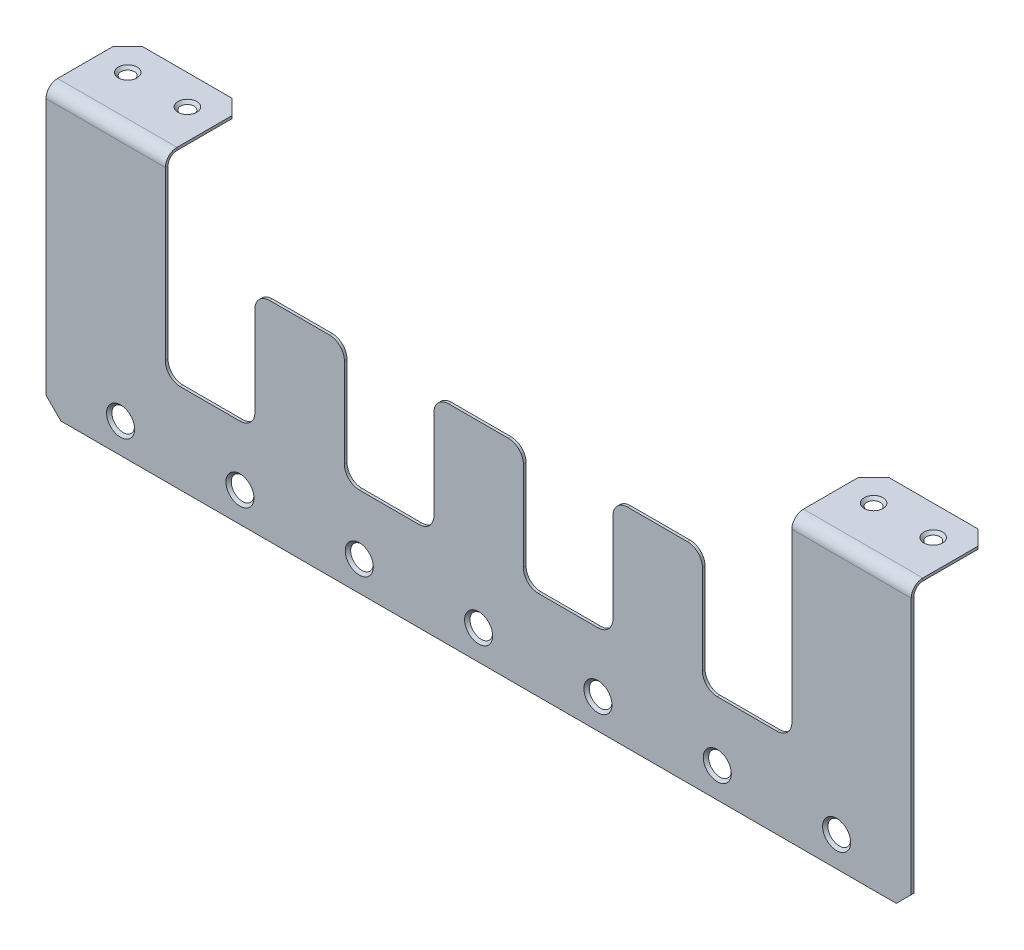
ISO-10303-21;
HEADER;
FILE_DESCRIPTION(('STEP AP214'),'2;1');
FILE_NAME('part.step','',(''),(''),'','','');
FILE_SCHEMA(('AUTOMOTIVE_DESIGN { 1 0 10303 214 1 1 1 1 }'));
ENDSEC;
DATA;
#1=APPLICATION_CONTEXT('core data for automotive mechanical design processes');
#2=APPLICATION_PROTOCOL_DEFINITION('international standard','automotive_design',2000,#1);
#3=PRODUCT_CONTEXT('',#1,'mechanical');
#4=PRODUCT('Part','Part','',(#3));
#5=PRODUCT_RELATED_PRODUCT_CATEGORY('part','',(#4));
#6=PRODUCT_DEFINITION_FORMATION('','',#4);
#7=PRODUCT_DEFINITION_CONTEXT('part definition',#1,'design');
#8=PRODUCT_DEFINITION('design','',#6,#7);
#9=PRODUCT_DEFINITION_SHAPE('','',#8);
#10=(LENGTH_UNIT() NAMED_UNIT(*) SI_UNIT(.MILLI.,.METRE.));
#11=(NAMED_UNIT(*) PLANE_ANGLE_UNIT() SI_UNIT($,.RADIAN.));
#12=(NAMED_UNIT(*) SI_UNIT($,.STERADIAN.) SOLID_ANGLE_UNIT());
#13=UNCERTAINTY_MEASURE_WITH_UNIT(LENGTH_MEASURE(1.E-05),#10,'distance_accuracy_value','');
#14=(GEOMETRIC_REPRESENTATION_CONTEXT(3) GLOBAL_UNCERTAINTY_ASSIGNED_CONTEXT((#13)) GLOBAL_UNIT_ASSIGNED_CONTEXT((#10,
#11,#12)) REPRESENTATION_CONTEXT('',''));
#15=CARTESIAN_POINT('',(0.,0.,0.));
#16=DIRECTION('',(0.,0.,1.));
#17=DIRECTION('',(1.,0.,0.));
#18=AXIS2_PLACEMENT_3D('',#15,#16,#17);
#19=CARTESIAN_POINT('',(0.,95.0000000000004,92.6192473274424));
#20=DIRECTION('',(0.,-1.,0.));
#21=DIRECTION('',(-1.,0.,0.));
#22=AXIS2_PLACEMENT_3D('',#19,#20,#21);
#23=PLANE('',#22);
#24=CARTESIAN_POINT('',(30.,95.,-17.3807526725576));
#25=DIRECTION('',(0.,1.,0.));
#26=DIRECTION('',(0.,0.,1.));
#27=AXIS2_PLACEMENT_3D('',#24,#25,#26);
#28=CIRCLE('',#27,3.15);
#29=CARTESIAN_POINT('',(30.,95.,-14.2307526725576));
#30=VERTEX_POINT('',#29);
#31=EDGE_CURVE('E1661',#30,#30,#28,.T.);
#32=ORIENTED_EDGE('',*,*,#31,.F.);
#33=EDGE_LOOP('',(#32));
#34=FACE_BOUND('',#33,.T.);
#35=DIRECTION('',(0.,0.,-1.));
#36=VECTOR('',#35,1.);
#37=CARTESIAN_POINT('',(40.,94.9999999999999,-27.3807526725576));
#38=LINE('',#37,#36);
#39=CARTESIAN_POINT('',(40.,95.,-3.90000000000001));
#40=VERTEX_POINT('',#39);
#41=CARTESIAN_POINT('',(40.,95.,-22.3807526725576));
#42=VERTEX_POINT('',#41);
#43=EDGE_CURVE('E411',#40,#42,#38,.T.);
#44=ORIENTED_EDGE('',*,*,#43,.T.);
#45=DIRECTION('',(0.707106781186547,0.,0.707106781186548));
#46=VECTOR('',#45,1.);
#47=CARTESIAN_POINT('',(40.,95.,-22.3807526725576));
#48=LINE('',#47,#46);
#49=CARTESIAN_POINT('',(35.,94.9999999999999,-27.3807526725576));
#50=VERTEX_POINT('',#49);
#51=EDGE_CURVE('E64',#42,#50,#48,.F.);
#52=ORIENTED_EDGE('',*,*,#51,.T.);
#53=DIRECTION('',(-1.,0.,0.));
#54=VECTOR('',#53,1.);
#55=CARTESIAN_POINT('',(0.,94.9999999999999,-27.3807526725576));
#56=LINE('',#55,#54);
#57=CARTESIAN_POINT('',(5.,94.9999999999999,-27.3807526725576));
#58=VERTEX_POINT('',#57);
#59=EDGE_CURVE('E536',#50,#58,#56,.T.);
#60=ORIENTED_EDGE('',*,*,#59,.T.);
#61=DIRECTION('',(0.707106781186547,0.,-0.707106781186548));
#62=VECTOR('',#61,1.);
#63=CARTESIAN_POINT('',(5.,94.9999999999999,-27.3807526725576));
#64=LINE('',#63,#62);
#65=CARTESIAN_POINT('',(0.,95.,-22.3807526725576));
#66=VERTEX_POINT('',#65);
#67=EDGE_CURVE('E721',#58,#66,#64,.F.);
#68=ORIENTED_EDGE('',*,*,#67,.T.);
#69=DIRECTION('',(0.,0.,1.));
#70=VECTOR('',#69,1.);
#71=CARTESIAN_POINT('',(0.,95.0000000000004,92.6192473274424));
#72=LINE('',#71,#70);
#73=CARTESIAN_POINT('',(0.,95.,-3.9));
#74=VERTEX_POINT('',#73);
#75=EDGE_CURVE('E538',#66,#74,#72,.T.);
#76=ORIENTED_EDGE('',*,*,#75,.T.);
#77=DIRECTION('',(1.,0.,0.));
#78=VECTOR('',#77,1.);
#79=CARTESIAN_POINT('',(0.,95.,-3.9));
#80=LINE('',#79,#78);
#81=EDGE_CURVE('E545',#74,#40,#80,.T.);
#82=ORIENTED_EDGE('',*,*,#81,.T.);
#83=EDGE_LOOP('',(#44,#52,#60,#68,#76,#82));
#84=FACE_BOUND('',#83,.T.);
#85=CARTESIAN_POINT('',(10.,95.,-17.3807526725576));
#86=DIRECTION('',(0.,1.,0.));
#87=DIRECTION('',(0.,0.,1.));
#88=AXIS2_PLACEMENT_3D('',#85,#86,#87);
#89=CIRCLE('',#88,3.15);
#90=CARTESIAN_POINT('',(10.,95.,-14.2307526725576));
#91=VERTEX_POINT('',#90);
#92=EDGE_CURVE('E1667',#91,#91,#89,.T.);
#93=ORIENTED_EDGE('',*,*,#92,.F.);
#94=EDGE_LOOP('',(#93));
#95=FACE_BOUND('',#94,.T.);
#96=ADVANCED_FACE('F42',(#34,#84,#95),#23,.F.);
#97=CARTESIAN_POINT('',(0.,0.,0.));
#98=DIRECTION('',(0.,0.,-1.));
#99=DIRECTION('',(-1.,0.,0.));
#100=AXIS2_PLACEMENT_3D('',#97,#98,#99);
#101=PLANE('',#100);
#102=CARTESIAN_POINT('',(65.,9.99999999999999,0.));
#103=DIRECTION('',(0.,0.,1.));
#104=DIRECTION('',(1.,0.,0.));
#105=AXIS2_PLACEMENT_3D('',#102,#103,#104);
#106=CIRCLE('',#105,4.7);
#107=CARTESIAN_POINT('',(69.7,9.99999999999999,0.));
#108=VERTEX_POINT('',#107);
#109=EDGE_CURVE('E1637',#108,#108,#106,.T.);
#110=ORIENTED_EDGE('',*,*,#109,.F.);
#111=EDGE_LOOP('',(#110));
#112=FACE_BOUND('',#111,.T.);
#113=CARTESIAN_POINT('',(105.,9.99999999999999,0.));
#114=DIRECTION('',(0.,0.,1.));
#115=DIRECTION('',(1.,0.,0.));
#116=AXIS2_PLACEMENT_3D('',#113,#114,#115);
#117=CIRCLE('',#116,4.7);
#118=CARTESIAN_POINT('',(109.7,9.99999999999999,0.));
#119=VERTEX_POINT('',#118);
#120=EDGE_CURVE('E1631',#119,#119,#117,.T.);
#121=ORIENTED_EDGE('',*,*,#120,.F.);
#122=EDGE_LOOP('',(#121));
#123=FACE_BOUND('',#122,.T.);
#124=CARTESIAN_POINT('',(145.,9.99999999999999,0.));
#125=DIRECTION('',(0.,0.,1.));
#126=DIRECTION('',(1.,0.,0.));
#127=AXIS2_PLACEMENT_3D('',#124,#125,#126);
#128=CIRCLE('',#127,4.70000000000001);
#129=CARTESIAN_POINT('',(149.7,9.99999999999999,0.));
#130=VERTEX_POINT('',#129);
#131=EDGE_CURVE('E1625',#130,#130,#128,.T.);
#132=ORIENTED_EDGE('',*,*,#131,.F.);
#133=EDGE_LOOP('',(#132));
#134=FACE_BOUND('',#133,.T.);
#135=CARTESIAN_POINT('',(185.,9.99999999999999,0.));
#136=DIRECTION('',(0.,0.,1.));
#137=DIRECTION('',(1.,0.,0.));
#138=AXIS2_PLACEMENT_3D('',#135,#136,#137);
#139=CIRCLE('',#138,4.70000000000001);
#140=CARTESIAN_POINT('',(189.7,9.99999999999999,0.));
#141=VERTEX_POINT('',#140);
#142=EDGE_CURVE('E1619',#141,#141,#139,.T.);
#143=ORIENTED_EDGE('',*,*,#142,.F.);
#144=EDGE_LOOP('',(#143));
#145=FACE_BOUND('',#144,.T.);
#146=CARTESIAN_POINT('',(225.,9.99999999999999,0.));
#147=DIRECTION('',(0.,0.,1.));
#148=DIRECTION('',(1.,0.,0.));
#149=AXIS2_PLACEMENT_3D('',#146,#147,#148);
#150=CIRCLE('',#149,4.70000000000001);
#151=CARTESIAN_POINT('',(229.7,9.99999999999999,0.));
#152=VERTEX_POINT('',#151);
#153=EDGE_CURVE('E1613',#152,#152,#150,.T.);
#154=ORIENTED_EDGE('',*,*,#153,.F.);
#155=EDGE_LOOP('',(#154));
#156=FACE_BOUND('',#155,.T.);
#157=CARTESIAN_POINT('',(265.,9.99999999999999,0.));
#158=DIRECTION('',(0.,0.,1.));
#159=DIRECTION('',(1.,0.,0.));
#160=AXIS2_PLACEMENT_3D('',#157,#158,#159);
#161=CIRCLE('',#160,4.69999999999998);
#162=CARTESIAN_POINT('',(269.7,9.99999999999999,0.));
#163=VERTEX_POINT('',#162);
#164=EDGE_CURVE('E1602',#163,#163,#161,.T.);
#165=ORIENTED_EDGE('',*,*,#164,.F.);
#166=EDGE_LOOP('',(#165));
#167=FACE_BOUND('',#166,.T.);
#168=DIRECTION('',(0.,-1.,0.));
#169=VECTOR('',#168,1.);
#170=CARTESIAN_POINT('',(0.,0.,0.));
#171=LINE('',#170,#169);
#172=CARTESIAN_POINT('',(0.,91.1,0.));
#173=VERTEX_POINT('',#172);
#174=CARTESIAN_POINT('',(0.,5.,0.));
#175=VERTEX_POINT('',#174);
#176=EDGE_CURVE('E474',#173,#175,#171,.T.);
#177=ORIENTED_EDGE('',*,*,#176,.T.);
#178=DIRECTION('',(-0.707106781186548,0.707106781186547,0.));
#179=VECTOR('',#178,1.);
#180=CARTESIAN_POINT('',(0.,5.,0.));
#181=LINE('',#180,#179);
#182=CARTESIAN_POINT('',(5.,0.,0.));
#183=VERTEX_POINT('',#182);
#184=EDGE_CURVE('E712',#175,#183,#181,.F.);
#185=ORIENTED_EDGE('',*,*,#184,.T.);
#186=DIRECTION('',(1.,0.,0.));
#187=VECTOR('',#186,1.);
#188=CARTESIAN_POINT('',(290.,0.,0.));
#189=LINE('',#188,#187);
#190=CARTESIAN_POINT('',(285.,0.,0.));
#191=VERTEX_POINT('',#190);
#192=EDGE_CURVE('E472',#183,#191,#189,.T.);
#193=ORIENTED_EDGE('',*,*,#192,.T.);
#194=DIRECTION('',(-0.707106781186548,-0.707106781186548,0.));
#195=VECTOR('',#194,1.);
#196=CARTESIAN_POINT('',(285.,0.,0.));
#197=LINE('',#196,#195);
#198=CARTESIAN_POINT('',(290.,5.,0.));
#199=VERTEX_POINT('',#198);
#200=EDGE_CURVE('E702',#191,#199,#197,.F.);
#201=ORIENTED_EDGE('',*,*,#200,.T.);
#202=DIRECTION('',(0.,1.,0.));
#203=VECTOR('',#202,1.);
#204=CARTESIAN_POINT('',(290.,120.,0.));
#205=LINE('',#204,#203);
#206=CARTESIAN_POINT('',(290.,91.1,0.));
#207=VERTEX_POINT('',#206);
#208=EDGE_CURVE('E470',#199,#207,#205,.T.);
#209=ORIENTED_EDGE('',*,*,#208,.T.);
#210=DIRECTION('',(1.,0.,0.));
#211=VECTOR('',#210,1.);
#212=CARTESIAN_POINT('',(0.,91.1,0.));
#213=LINE('',#212,#211);
#214=CARTESIAN_POINT('',(250.,91.1,0.));
#215=VERTEX_POINT('',#214);
#216=EDGE_CURVE('E403',#215,#207,#213,.T.);
#217=ORIENTED_EDGE('',*,*,#216,.F.);
#218=DIRECTION('',(0.,-1.,0.));
#219=VECTOR('',#218,1.);
#220=CARTESIAN_POINT('',(250.,30.,0.));
#221=LINE('',#220,#219);
#222=CARTESIAN_POINT('',(250.,35.,0.));
#223=VERTEX_POINT('',#222);
#224=EDGE_CURVE('E467',#215,#223,#221,.T.);
#225=ORIENTED_EDGE('',*,*,#224,.T.);
#226=CARTESIAN_POINT('',(245.,35.,0.));
#227=DIRECTION('',(0.,0.,-1.));
#228=DIRECTION('',(-1.,0.,0.));
#229=AXIS2_PLACEMENT_3D('',#226,#227,#228);
#230=CIRCLE('',#229,5.);
#231=CARTESIAN_POINT('',(245.,30.,0.));
#232=VERTEX_POINT('',#231);
#233=EDGE_CURVE('E650',#223,#232,#230,.T.);
#234=ORIENTED_EDGE('',*,*,#233,.T.);
#235=DIRECTION('',(-1.,0.,0.));
#236=VECTOR('',#235,1.);
#237=CARTESIAN_POINT('',(220.,30.,0.));
#238=LINE('',#237,#236);
#239=CARTESIAN_POINT('',(225.,30.,0.));
#240=VERTEX_POINT('',#239);
#241=EDGE_CURVE('E464',#232,#240,#238,.T.);
#242=ORIENTED_EDGE('',*,*,#241,.T.);
#243=CARTESIAN_POINT('',(225.,35.,0.));
#244=DIRECTION('',(0.,0.,-1.));
#245=DIRECTION('',(-1.,0.,0.));
#246=AXIS2_PLACEMENT_3D('',#243,#244,#245);
#247=CIRCLE('',#246,5.);
#248=CARTESIAN_POINT('',(220.,35.,0.));
#249=VERTEX_POINT('',#248);
#250=EDGE_CURVE('E654',#240,#249,#247,.T.);
#251=ORIENTED_EDGE('',*,*,#250,.T.);
#252=DIRECTION('',(0.,1.,0.));
#253=VECTOR('',#252,1.);
#254=CARTESIAN_POINT('',(220.,70.,0.));
#255=LINE('',#254,#253);
#256=CARTESIAN_POINT('',(220.,65.,0.));
#257=VERTEX_POINT('',#256);
#258=EDGE_CURVE('E461',#249,#257,#255,.T.);
#259=ORIENTED_EDGE('',*,*,#258,.T.);
#260=CARTESIAN_POINT('',(215.,65.,0.));
#261=DIRECTION('',(0.,0.,-1.));
#262=DIRECTION('',(-1.,0.,0.));
#263=AXIS2_PLACEMENT_3D('',#260,#261,#262);
#264=CIRCLE('',#263,5.);
#265=CARTESIAN_POINT('',(215.,70.,0.));
#266=VERTEX_POINT('',#265);
#267=EDGE_CURVE('E579',#257,#266,#264,.F.);
#268=ORIENTED_EDGE('',*,*,#267,.T.);
#269=DIRECTION('',(-1.,0.,0.));
#270=VECTOR('',#269,1.);
#271=CARTESIAN_POINT('',(190.,70.,0.));
#272=LINE('',#271,#270);
#273=CARTESIAN_POINT('',(195.,70.,0.));
#274=VERTEX_POINT('',#273);
#275=EDGE_CURVE('E458',#266,#274,#272,.T.);
#276=ORIENTED_EDGE('',*,*,#275,.T.);
#277=CARTESIAN_POINT('',(195.,65.,0.));
#278=DIRECTION('',(0.,0.,-1.));
#279=DIRECTION('',(-1.,0.,0.));
#280=AXIS2_PLACEMENT_3D('',#277,#278,#279);
#281=CIRCLE('',#280,5.);
#282=CARTESIAN_POINT('',(190.,65.,0.));
#283=VERTEX_POINT('',#282);
#284=EDGE_CURVE('E577',#274,#283,#281,.F.);
#285=ORIENTED_EDGE('',*,*,#284,.T.);
#286=DIRECTION('',(0.,-1.,0.));
#287=VECTOR('',#286,1.);
#288=CARTESIAN_POINT('',(190.,30.,0.));
#289=LINE('',#288,#287);
#290=CARTESIAN_POINT('',(190.,35.,0.));
#291=VERTEX_POINT('',#290);
#292=EDGE_CURVE('E455',#283,#291,#289,.T.);
#293=ORIENTED_EDGE('',*,*,#292,.T.);
#294=CARTESIAN_POINT('',(185.,35.,0.));
#295=DIRECTION('',(0.,0.,-1.));
#296=DIRECTION('',(-1.,0.,0.));
#297=AXIS2_PLACEMENT_3D('',#294,#295,#296);
#298=CIRCLE('',#297,5.);
#299=CARTESIAN_POINT('',(185.,30.,0.));
#300=VERTEX_POINT('',#299);
#301=EDGE_CURVE('E658',#291,#300,#298,.T.);
#302=ORIENTED_EDGE('',*,*,#301,.T.);
#303=DIRECTION('',(-1.,0.,0.));
#304=VECTOR('',#303,1.);
#305=CARTESIAN_POINT('',(160.,30.,0.));
#306=LINE('',#305,#304);
#307=CARTESIAN_POINT('',(165.,30.,0.));
#308=VERTEX_POINT('',#307);
#309=EDGE_CURVE('E452',#300,#308,#306,.T.);
#310=ORIENTED_EDGE('',*,*,#309,.T.);
#311=CARTESIAN_POINT('',(165.,35.,0.));
#312=DIRECTION('',(0.,0.,-1.));
#313=DIRECTION('',(-1.,0.,0.));
#314=AXIS2_PLACEMENT_3D('',#311,#312,#313);
#315=CIRCLE('',#314,5.);
#316=CARTESIAN_POINT('',(160.,35.,0.));
#317=VERTEX_POINT('',#316);
#318=EDGE_CURVE('E662',#308,#317,#315,.T.);
#319=ORIENTED_EDGE('',*,*,#318,.T.);
#320=DIRECTION('',(0.,1.,0.));
#321=VECTOR('',#320,1.);
#322=CARTESIAN_POINT('',(160.,70.,0.));
#323=LINE('',#322,#321);
#324=CARTESIAN_POINT('',(160.,65.,0.));
#325=VERTEX_POINT('',#324);
#326=EDGE_CURVE('E449',#317,#325,#323,.T.);
#327=ORIENTED_EDGE('',*,*,#326,.T.);
#328=CARTESIAN_POINT('',(155.,65.,0.));
#329=DIRECTION('',(0.,0.,-1.));
#330=DIRECTION('',(-1.,0.,0.));
#331=AXIS2_PLACEMENT_3D('',#328,#329,#330);
#332=CIRCLE('',#331,5.);
#333=CARTESIAN_POINT('',(155.,70.,0.));
#334=VERTEX_POINT('',#333);
#335=EDGE_CURVE('E575',#325,#334,#332,.F.);
#336=ORIENTED_EDGE('',*,*,#335,.T.);
#337=DIRECTION('',(-1.,0.,0.));
#338=VECTOR('',#337,1.);
#339=CARTESIAN_POINT('',(130.,70.,0.));
#340=LINE('',#339,#338);
#341=CARTESIAN_POINT('',(135.,70.,0.));
#342=VERTEX_POINT('',#341);
#343=EDGE_CURVE('E446',#334,#342,#340,.T.);
#344=ORIENTED_EDGE('',*,*,#343,.T.);
#345=CARTESIAN_POINT('',(135.,65.,0.));
#346=DIRECTION('',(0.,0.,-1.));
#347=DIRECTION('',(-1.,0.,0.));
#348=AXIS2_PLACEMENT_3D('',#345,#346,#347);
#349=CIRCLE('',#348,5.);
#350=CARTESIAN_POINT('',(130.,65.,0.));
#351=VERTEX_POINT('',#350);
#352=EDGE_CURVE('E573',#342,#351,#349,.F.);
#353=ORIENTED_EDGE('',*,*,#352,.T.);
#354=DIRECTION('',(0.,-1.,0.));
#355=VECTOR('',#354,1.);
#356=CARTESIAN_POINT('',(130.,30.,0.));
#357=LINE('',#356,#355);
#358=CARTESIAN_POINT('',(130.,35.,0.));
#359=VERTEX_POINT('',#358);
#360=EDGE_CURVE('E443',#351,#359,#357,.T.);
#361=ORIENTED_EDGE('',*,*,#360,.T.);
#362=CARTESIAN_POINT('',(125.,35.,0.));
#363=DIRECTION('',(0.,0.,-1.));
#364=DIRECTION('',(-1.,0.,0.));
#365=AXIS2_PLACEMENT_3D('',#362,#363,#364);
#366=CIRCLE('',#365,5.);
#367=CARTESIAN_POINT('',(125.,30.,0.));
#368=VERTEX_POINT('',#367);
#369=EDGE_CURVE('E666',#359,#368,#366,.T.);
#370=ORIENTED_EDGE('',*,*,#369,.T.);
#371=DIRECTION('',(-1.,0.,0.));
#372=VECTOR('',#371,1.);
#373=CARTESIAN_POINT('',(100.,30.,0.));
#374=LINE('',#373,#372);
#375=CARTESIAN_POINT('',(105.,30.,0.));
#376=VERTEX_POINT('',#375);
#377=EDGE_CURVE('E440',#368,#376,#374,.T.);
#378=ORIENTED_EDGE('',*,*,#377,.T.);
#379=CARTESIAN_POINT('',(105.,35.,0.));
#380=DIRECTION('',(0.,0.,-1.));
#381=DIRECTION('',(-1.,0.,0.));
#382=AXIS2_PLACEMENT_3D('',#379,#380,#381);
#383=CIRCLE('',#382,5.);
#384=CARTESIAN_POINT('',(100.,35.,0.));
#385=VERTEX_POINT('',#384);
#386=EDGE_CURVE('E670',#376,#385,#383,.T.);
#387=ORIENTED_EDGE('',*,*,#386,.T.);
#388=DIRECTION('',(0.,1.,0.));
#389=VECTOR('',#388,1.);
#390=CARTESIAN_POINT('',(100.,70.,0.));
#391=LINE('',#390,#389);
#392=CARTESIAN_POINT('',(100.,65.,0.));
#393=VERTEX_POINT('',#392);
#394=EDGE_CURVE('E437',#385,#393,#391,.T.);
#395=ORIENTED_EDGE('',*,*,#394,.T.);
#396=CARTESIAN_POINT('',(95.,65.,0.));
#397=DIRECTION('',(0.,0.,-1.));
#398=DIRECTION('',(-1.,0.,0.));
#399=AXIS2_PLACEMENT_3D('',#396,#397,#398);
#400=CIRCLE('',#399,5.);
#401=CARTESIAN_POINT('',(95.,70.,0.));
#402=VERTEX_POINT('',#401);
#403=EDGE_CURVE('E571',#393,#402,#400,.F.);
#404=ORIENTED_EDGE('',*,*,#403,.T.);
#405=DIRECTION('',(-1.,0.,0.));
#406=VECTOR('',#405,1.);
#407=CARTESIAN_POINT('',(70.,70.,0.));
#408=LINE('',#407,#406);
#409=CARTESIAN_POINT('',(75.,70.,0.));
#410=VERTEX_POINT('',#409);
#411=EDGE_CURVE('E434',#402,#410,#408,.T.);
#412=ORIENTED_EDGE('',*,*,#411,.T.);
#413=CARTESIAN_POINT('',(75.,65.,0.));
#414=DIRECTION('',(0.,0.,-1.));
#415=DIRECTION('',(-1.,0.,0.));
#416=AXIS2_PLACEMENT_3D('',#413,#414,#415);
#417=CIRCLE('',#416,5.);
#418=CARTESIAN_POINT('',(70.,65.,0.));
#419=VERTEX_POINT('',#418);
#420=EDGE_CURVE('E569',#410,#419,#417,.F.);
#421=ORIENTED_EDGE('',*,*,#420,.T.);
#422=DIRECTION('',(0.,-1.,0.));
#423=VECTOR('',#422,1.);
#424=CARTESIAN_POINT('',(70.,30.,0.));
#425=LINE('',#424,#423);
#426=CARTESIAN_POINT('',(70.,35.,0.));
#427=VERTEX_POINT('',#426);
#428=EDGE_CURVE('E431',#419,#427,#425,.T.);
#429=ORIENTED_EDGE('',*,*,#428,.T.);
#430=CARTESIAN_POINT('',(65.,35.,0.));
#431=DIRECTION('',(0.,0.,-1.));
#432=DIRECTION('',(-1.,0.,0.));
#433=AXIS2_PLACEMENT_3D('',#430,#431,#432);
#434=CIRCLE('',#433,5.);
#435=CARTESIAN_POINT('',(65.,30.,0.));
#436=VERTEX_POINT('',#435);
#437=EDGE_CURVE('E674',#427,#436,#434,.T.);
#438=ORIENTED_EDGE('',*,*,#437,.T.);
#439=DIRECTION('',(-1.,0.,0.));
#440=VECTOR('',#439,1.);
#441=CARTESIAN_POINT('',(40.,30.,0.));
#442=LINE('',#441,#440);
#443=CARTESIAN_POINT('',(45.,30.,0.));
#444=VERTEX_POINT('',#443);
#445=EDGE_CURVE('E428',#436,#444,#442,.T.);
#446=ORIENTED_EDGE('',*,*,#445,.T.);
#447=CARTESIAN_POINT('',(45.,35.,0.));
#448=DIRECTION('',(0.,0.,-1.));
#449=DIRECTION('',(-1.,0.,0.));
#450=AXIS2_PLACEMENT_3D('',#447,#448,#449);
#451=CIRCLE('',#450,5.);
#452=CARTESIAN_POINT('',(40.,35.,0.));
#453=VERTEX_POINT('',#452);
#454=EDGE_CURVE('E678',#444,#453,#451,.T.);
#455=ORIENTED_EDGE('',*,*,#454,.T.);
#456=DIRECTION('',(0.,1.,0.));
#457=VECTOR('',#456,1.);
#458=CARTESIAN_POINT('',(40.,120.,0.));
#459=LINE('',#458,#457);
#460=CARTESIAN_POINT('',(40.,91.1,0.));
#461=VERTEX_POINT('',#460);
#462=EDGE_CURVE('E426',#453,#461,#459,.T.);
#463=ORIENTED_EDGE('',*,*,#462,.T.);
#464=DIRECTION('',(1.,0.,0.));
#465=VECTOR('',#464,1.);
#466=CARTESIAN_POINT('',(0.,91.1,0.));
#467=LINE('',#466,#465);
#468=EDGE_CURVE('E527',#173,#461,#467,.T.);
#469=ORIENTED_EDGE('',*,*,#468,.F.);
#470=EDGE_LOOP('',(#177,#185,#193,#201,#209,#217,#225,#234,#242,#251,#259,#268,#276,#285,#293,
#302,#310,#319,#327,#336,#344,#353,#361,#370,#378,#387,#395,#404,#412,#421,#429,#438,#446,#455,
#463,#469));
#471=FACE_BOUND('',#470,.T.);
#472=CARTESIAN_POINT('',(25.,10.,0.));
#473=DIRECTION('',(0.,0.,1.));
#474=DIRECTION('',(1.,0.,0.));
#475=AXIS2_PLACEMENT_3D('',#472,#473,#474);
#476=CIRCLE('',#475,4.7);
#477=CARTESIAN_POINT('',(29.7,10.,0.));
#478=VERTEX_POINT('',#477);
#479=EDGE_CURVE('E1643',#478,#478,#476,.T.);
#480=ORIENTED_EDGE('',*,*,#479,.F.);
#481=EDGE_LOOP('',(#480));
#482=FACE_BOUND('',#481,.T.);
#483=ADVANCED_FACE('F752',(#112,#123,#134,#145,#156,#167,#471,#482),#101,.F.);
#484=CARTESIAN_POINT('',(0.,94.1000000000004,92.6192473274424));
#485=DIRECTION('',(0.,-1.,0.));
#486=DIRECTION('',(-1.,0.,0.));
#487=AXIS2_PLACEMENT_3D('',#484,#485,#486);
#488=PLANE('',#487);
#489=CARTESIAN_POINT('',(10.,94.1,-17.3807526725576));
#490=DIRECTION('',(0.,-1.,0.));
#491=DIRECTION('',(0.,0.,-1.));
#492=AXIS2_PLACEMENT_3D('',#489,#490,#491);
#493=CIRCLE('',#492,2.24999999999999);
#494=CARTESIAN_POINT('',(10.,94.1,-19.6307526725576));
#495=VERTEX_POINT('',#494);
#496=EDGE_CURVE('E1664',#495,#495,#493,.T.);
#497=ORIENTED_EDGE('',*,*,#496,.F.);
#498=EDGE_LOOP('',(#497));
#499=FACE_BOUND('',#498,.T.);
#500=CARTESIAN_POINT('',(30.,94.1,-17.3807526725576));
#501=DIRECTION('',(0.,-1.,0.));
#502=DIRECTION('',(0.,0.,-1.));
#503=AXIS2_PLACEMENT_3D('',#500,#501,#502);
#504=CIRCLE('',#503,2.25);
#505=CARTESIAN_POINT('',(30.,94.1,-19.6307526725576));
#506=VERTEX_POINT('',#505);
#507=EDGE_CURVE('E1658',#506,#506,#504,.T.);
#508=ORIENTED_EDGE('',*,*,#507,.F.);
#509=EDGE_LOOP('',(#508));
#510=FACE_BOUND('',#509,.T.);
#511=DIRECTION('',(-1.,0.,0.));
#512=VECTOR('',#511,1.);
#513=CARTESIAN_POINT('',(0.,94.1,-27.3807526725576));
#514=LINE('',#513,#512);
#515=CARTESIAN_POINT('',(35.,94.1,-27.3807526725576));
#516=VERTEX_POINT('',#515);
#517=CARTESIAN_POINT('',(5.00000000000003,94.1,-27.3807526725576));
#518=VERTEX_POINT('',#517);
#519=EDGE_CURVE('E532',#516,#518,#514,.T.);
#520=ORIENTED_EDGE('',*,*,#519,.F.);
#521=DIRECTION('',(-0.707106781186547,0.,-0.707106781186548));
#522=VECTOR('',#521,1.);
#523=CARTESIAN_POINT('',(77.5,94.1000000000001,15.1192473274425));
#524=LINE('',#523,#522);
#525=CARTESIAN_POINT('',(40.,94.1,-22.3807526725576));
#526=VERTEX_POINT('',#525);
#527=EDGE_CURVE('E12',#516,#526,#524,.F.);
#528=ORIENTED_EDGE('',*,*,#527,.T.);
#529=DIRECTION('',(0.,0.,-1.));
#530=VECTOR('',#529,1.);
#531=CARTESIAN_POINT('',(40.,94.1,-27.3807526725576));
#532=LINE('',#531,#530);
#533=CARTESIAN_POINT('',(40.,94.1,-3.90000000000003));
#534=VERTEX_POINT('',#533);
#535=EDGE_CURVE('E535',#534,#526,#532,.T.);
#536=ORIENTED_EDGE('',*,*,#535,.F.);
#537=DIRECTION('',(1.,0.,0.));
#538=VECTOR('',#537,1.);
#539=CARTESIAN_POINT('',(0.,94.1,-3.9));
#540=LINE('',#539,#538);
#541=CARTESIAN_POINT('',(0.,94.1,-3.9));
#542=VERTEX_POINT('',#541);
#543=EDGE_CURVE('E539',#542,#534,#540,.T.);
#544=ORIENTED_EDGE('',*,*,#543,.F.);
#545=DIRECTION('',(0.,0.,1.));
#546=VECTOR('',#545,1.);
#547=CARTESIAN_POINT('',(0.,94.1000000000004,92.6192473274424));
#548=LINE('',#547,#546);
#549=CARTESIAN_POINT('',(0.,94.1,-22.3807526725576));
#550=VERTEX_POINT('',#549);
#551=EDGE_CURVE('E534',#550,#542,#548,.T.);
#552=ORIENTED_EDGE('',*,*,#551,.F.);
#553=DIRECTION('',(-0.707106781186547,0.,0.707106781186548));
#554=VECTOR('',#553,1.);
#555=CARTESIAN_POINT('',(-57.5,94.1000000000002,35.1192473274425));
#556=LINE('',#555,#554);
#557=EDGE_CURVE('E725',#550,#518,#556,.F.);
#558=ORIENTED_EDGE('',*,*,#557,.T.);
#559=EDGE_LOOP('',(#520,#528,#536,#544,#552,#558));
#560=FACE_BOUND('',#559,.T.);
#561=ADVANCED_FACE('F935',(#499,#510,#560),#488,.T.);
#562=CARTESIAN_POINT('',(0.,94.1000000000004,92.6192473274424));
#563=DIRECTION('',(-1.,0.,0.));
#564=DIRECTION('',(0.,1.,0.));
#565=AXIS2_PLACEMENT_3D('',#562,#563,#564);
#566=PLANE('',#565);
#567=ORIENTED_EDGE('',*,*,#75,.F.);
#568=DIRECTION('',(0.,-1.,0.));
#569=VECTOR('',#568,1.);
#570=CARTESIAN_POINT('',(0.,94.1,-22.3807526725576));
#571=LINE('',#570,#569);
#572=EDGE_CURVE('E723',#66,#550,#571,.T.);
#573=ORIENTED_EDGE('',*,*,#572,.T.);
#574=ORIENTED_EDGE('',*,*,#551,.T.);
#575=DIRECTION('',(0.,-1.,0.));
#576=VECTOR('',#575,1.);
#577=CARTESIAN_POINT('',(0.,94.1000000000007,-3.9));
#578=LINE('',#577,#576);
#579=EDGE_CURVE('E548',#74,#542,#578,.T.);
#580=ORIENTED_EDGE('',*,*,#579,.F.);
#581=EDGE_LOOP('',(#567,#573,#574,#580));
#582=FACE_BOUND('',#581,.T.);
#583=ADVANCED_FACE('F1002',(#582),#566,.T.);
#584=CARTESIAN_POINT('',(0.,94.1,-27.3807526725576));
#585=DIRECTION('',(0.,0.,-1.));
#586=DIRECTION('',(0.,1.,0.));
#587=AXIS2_PLACEMENT_3D('',#584,#585,#586);
#588=PLANE('',#587);
#589=ORIENTED_EDGE('',*,*,#59,.F.);
#590=DIRECTION('',(0.,-1.,0.));
#591=VECTOR('',#590,1.);
#592=CARTESIAN_POINT('',(35.,94.1,-27.3807526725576));
#593=LINE('',#592,#591);
#594=EDGE_CURVE('E50',#50,#516,#593,.T.);
#595=ORIENTED_EDGE('',*,*,#594,.T.);
#596=ORIENTED_EDGE('',*,*,#519,.T.);
#597=DIRECTION('',(0.,1.,0.));
#598=VECTOR('',#597,1.);
#599=CARTESIAN_POINT('',(5.,94.1,-27.3807526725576));
#600=LINE('',#599,#598);
#601=EDGE_CURVE('E718',#518,#58,#600,.T.);
#602=ORIENTED_EDGE('',*,*,#601,.T.);
#603=EDGE_LOOP('',(#589,#595,#596,#602));
#604=FACE_BOUND('',#603,.T.);
#605=ADVANCED_FACE('F1014',(#604),#588,.T.);
#606=CARTESIAN_POINT('',(40.,94.1,-27.3807526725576));
#607=DIRECTION('',(1.,0.,0.));
#608=DIRECTION('',(0.,0.,-1.));
#609=AXIS2_PLACEMENT_3D('',#606,#607,#608);
#610=PLANE('',#609);
#611=ORIENTED_EDGE('',*,*,#535,.T.);
#612=DIRECTION('',(0.,1.,0.));
#613=VECTOR('',#612,1.);
#614=CARTESIAN_POINT('',(40.,94.1,-22.3807526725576));
#615=LINE('',#614,#613);
#616=EDGE_CURVE('E728',#526,#42,#615,.T.);
#617=ORIENTED_EDGE('',*,*,#616,.T.);
#618=ORIENTED_EDGE('',*,*,#43,.F.);
#619=DIRECTION('',(0.,1.,0.));
#620=VECTOR('',#619,1.);
#621=CARTESIAN_POINT('',(40.,94.0999999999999,-3.90000000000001));
#622=LINE('',#621,#620);
#623=EDGE_CURVE('E542',#534,#40,#622,.T.);
#624=ORIENTED_EDGE('',*,*,#623,.F.);
#625=EDGE_LOOP('',(#611,#617,#618,#624));
#626=FACE_BOUND('',#625,.T.);
#627=ADVANCED_FACE('F733',(#626),#610,.T.);
#628=CARTESIAN_POINT('',(290.,0.,-0.9));
#629=DIRECTION('',(0.,-1.,0.));
#630=DIRECTION('',(0.,0.,-1.));
#631=AXIS2_PLACEMENT_3D('',#628,#629,#630);
#632=PLANE('',#631);
#633=ORIENTED_EDGE('',*,*,#192,.F.);
#634=DIRECTION('',(0.,0.,-1.));
#635=VECTOR('',#634,1.);
#636=CARTESIAN_POINT('',(5.,0.,-0.9));
#637=LINE('',#636,#635);
#638=CARTESIAN_POINT('',(5.00000000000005,0.,-0.9));
#639=VERTEX_POINT('',#638);
#640=EDGE_CURVE('E714',#183,#639,#637,.T.);
#641=ORIENTED_EDGE('',*,*,#640,.T.);
#642=DIRECTION('',(1.,0.,0.));
#643=VECTOR('',#642,1.);
#644=CARTESIAN_POINT('',(290.,0.,-0.9));
#645=LINE('',#644,#643);
#646=CARTESIAN_POINT('',(285.,0.,-0.9));
#647=VERTEX_POINT('',#646);
#648=EDGE_CURVE('E525',#639,#647,#645,.T.);
#649=ORIENTED_EDGE('',*,*,#648,.T.);
#650=DIRECTION('',(0.,0.,1.));
#651=VECTOR('',#650,1.);
#652=CARTESIAN_POINT('',(285.,0.,-0.9));
#653=LINE('',#652,#651);
#654=EDGE_CURVE('E699',#647,#191,#653,.T.);
#655=ORIENTED_EDGE('',*,*,#654,.T.);
#656=EDGE_LOOP('',(#633,#641,#649,#655));
#657=FACE_BOUND('',#656,.T.);
#658=ADVANCED_FACE('F1033',(#657),#632,.T.);
#659=CARTESIAN_POINT('',(220.,30.,-0.9));
#660=DIRECTION('',(0.,1.,0.));
#661=DIRECTION('',(0.,0.,1.));
#662=AXIS2_PLACEMENT_3D('',#659,#660,#661);
#663=PLANE('',#662);
#664=ORIENTED_EDGE('',*,*,#241,.F.);
#665=DIRECTION('',(0.,0.,1.));
#666=VECTOR('',#665,1.);
#667=CARTESIAN_POINT('',(245.,30.,-0.9));
#668=LINE('',#667,#666);
#669=CARTESIAN_POINT('',(245.,30.,-0.9));
#670=VERTEX_POINT('',#669);
#671=EDGE_CURVE('E562',#232,#670,#668,.F.);
#672=ORIENTED_EDGE('',*,*,#671,.T.);
#673=DIRECTION('',(-1.,0.,0.));
#674=VECTOR('',#673,1.);
#675=CARTESIAN_POINT('',(220.,30.,-0.9));
#676=LINE('',#675,#674);
#677=CARTESIAN_POINT('',(225.,30.,-0.9));
#678=VERTEX_POINT('',#677);
#679=EDGE_CURVE('E522',#670,#678,#676,.T.);
#680=ORIENTED_EDGE('',*,*,#679,.T.);
#681=DIRECTION('',(0.,0.,1.));
#682=VECTOR('',#681,1.);
#683=CARTESIAN_POINT('',(225.,30.,0.));
#684=LINE('',#683,#682);
#685=EDGE_CURVE('E559',#678,#240,#684,.T.);
#686=ORIENTED_EDGE('',*,*,#685,.T.);
#687=EDGE_LOOP('',(#664,#672,#680,#686));
#688=FACE_BOUND('',#687,.T.);
#689=ADVANCED_FACE('F878',(#688),#663,.T.);
#690=CARTESIAN_POINT('',(220.,70.,-0.9));
#691=DIRECTION('',(1.,0.,0.));
#692=DIRECTION('',(0.,1.,0.));
#693=AXIS2_PLACEMENT_3D('',#690,#691,#692);
#694=PLANE('',#693);
#695=ORIENTED_EDGE('',*,*,#258,.F.);
#696=DIRECTION('',(0.,0.,1.));
#697=VECTOR('',#696,1.);
#698=CARTESIAN_POINT('',(220.,35.,-0.9));
#699=LINE('',#698,#697);
#700=CARTESIAN_POINT('',(220.,35.,-0.9));
#701=VERTEX_POINT('',#700);
#702=EDGE_CURVE('E567',#249,#701,#699,.F.);
#703=ORIENTED_EDGE('',*,*,#702,.T.);
#704=DIRECTION('',(0.,1.,0.));
#705=VECTOR('',#704,1.);
#706=CARTESIAN_POINT('',(220.,70.,-0.9));
#707=LINE('',#706,#705);
#708=CARTESIAN_POINT('',(220.,65.,-0.9));
#709=VERTEX_POINT('',#708);
#710=EDGE_CURVE('E519',#701,#709,#707,.T.);
#711=ORIENTED_EDGE('',*,*,#710,.T.);
#712=DIRECTION('',(0.,0.,1.));
#713=VECTOR('',#712,1.);
#714=CARTESIAN_POINT('',(220.,65.,-0.9));
#715=LINE('',#714,#713);
#716=EDGE_CURVE('E564',#709,#257,#715,.T.);
#717=ORIENTED_EDGE('',*,*,#716,.T.);
#718=EDGE_LOOP('',(#695,#703,#711,#717));
#719=FACE_BOUND('',#718,.T.);
#720=ADVANCED_FACE('F869',(#719),#694,.T.);
#721=CARTESIAN_POINT('',(190.,70.,-0.9));
#722=DIRECTION('',(0.,1.,0.));
#723=DIRECTION('',(0.,0.,1.));
#724=AXIS2_PLACEMENT_3D('',#721,#722,#723);
#725=PLANE('',#724);
#726=ORIENTED_EDGE('',*,*,#275,.F.);
#727=DIRECTION('',(0.,0.,1.));
#728=VECTOR('',#727,1.);
#729=CARTESIAN_POINT('',(215.,70.,-0.9));
#730=LINE('',#729,#728);
#731=CARTESIAN_POINT('',(215.,70.,-0.9));
#732=VERTEX_POINT('',#731);
#733=EDGE_CURVE('E584',#266,#732,#730,.F.);
#734=ORIENTED_EDGE('',*,*,#733,.T.);
#735=DIRECTION('',(-1.,0.,0.));
#736=VECTOR('',#735,1.);
#737=CARTESIAN_POINT('',(190.,70.,-0.9));
#738=LINE('',#737,#736);
#739=CARTESIAN_POINT('',(195.,70.,-0.9));
#740=VERTEX_POINT('',#739);
#741=EDGE_CURVE('E516',#732,#740,#738,.T.);
#742=ORIENTED_EDGE('',*,*,#741,.T.);
#743=DIRECTION('',(0.,0.,1.));
#744=VECTOR('',#743,1.);
#745=CARTESIAN_POINT('',(195.,70.,-0.9));
#746=LINE('',#745,#744);
#747=EDGE_CURVE('E581',#740,#274,#746,.T.);
#748=ORIENTED_EDGE('',*,*,#747,.T.);
#749=EDGE_LOOP('',(#726,#734,#742,#748));
#750=FACE_BOUND('',#749,.T.);
#751=ADVANCED_FACE('F860',(#750),#725,.T.);
#752=CARTESIAN_POINT('',(190.,30.,-0.9));
#753=DIRECTION('',(-1.,0.,0.));
#754=DIRECTION('',(0.,0.,1.));
#755=AXIS2_PLACEMENT_3D('',#752,#753,#754);
#756=PLANE('',#755);
#757=ORIENTED_EDGE('',*,*,#292,.F.);
#758=DIRECTION('',(0.,0.,1.));
#759=VECTOR('',#758,1.);
#760=CARTESIAN_POINT('',(190.,65.,-0.9));
#761=LINE('',#760,#759);
#762=CARTESIAN_POINT('',(190.,65.,-0.9));
#763=VERTEX_POINT('',#762);
#764=EDGE_CURVE('E601',#283,#763,#761,.F.);
#765=ORIENTED_EDGE('',*,*,#764,.T.);
#766=DIRECTION('',(0.,-1.,0.));
#767=VECTOR('',#766,1.);
#768=CARTESIAN_POINT('',(190.,30.,-0.9));
#769=LINE('',#768,#767);
#770=CARTESIAN_POINT('',(190.,35.,-0.9));
#771=VERTEX_POINT('',#770);
#772=EDGE_CURVE('E513',#763,#771,#769,.T.);
#773=ORIENTED_EDGE('',*,*,#772,.T.);
#774=DIRECTION('',(0.,0.,1.));
#775=VECTOR('',#774,1.);
#776=CARTESIAN_POINT('',(190.,35.,0.));
#777=LINE('',#776,#775);
#778=EDGE_CURVE('E598',#771,#291,#777,.T.);
#779=ORIENTED_EDGE('',*,*,#778,.T.);
#780=EDGE_LOOP('',(#757,#765,#773,#779));
#781=FACE_BOUND('',#780,.T.);
#782=ADVANCED_FACE('F851',(#781),#756,.T.);
#783=CARTESIAN_POINT('',(160.,30.,-0.9));
#784=DIRECTION('',(0.,1.,0.));
#785=DIRECTION('',(0.,0.,1.));
#786=AXIS2_PLACEMENT_3D('',#783,#784,#785);
#787=PLANE('',#786);
#788=ORIENTED_EDGE('',*,*,#309,.F.);
#789=DIRECTION('',(0.,0.,1.));
#790=VECTOR('',#789,1.);
#791=CARTESIAN_POINT('',(185.,30.,-0.9));
#792=LINE('',#791,#790);
#793=CARTESIAN_POINT('',(185.,30.,-0.9));
#794=VERTEX_POINT('',#793);
#795=EDGE_CURVE('E606',#300,#794,#792,.F.);
#796=ORIENTED_EDGE('',*,*,#795,.T.);
#797=DIRECTION('',(-1.,0.,0.));
#798=VECTOR('',#797,1.);
#799=CARTESIAN_POINT('',(160.,30.,-0.9));
#800=LINE('',#799,#798);
#801=CARTESIAN_POINT('',(165.,30.,-0.9));
#802=VERTEX_POINT('',#801);
#803=EDGE_CURVE('E510',#794,#802,#800,.T.);
#804=ORIENTED_EDGE('',*,*,#803,.T.);
#805=DIRECTION('',(0.,0.,1.));
#806=VECTOR('',#805,1.);
#807=CARTESIAN_POINT('',(165.,30.,0.));
#808=LINE('',#807,#806);
#809=EDGE_CURVE('E603',#802,#308,#808,.T.);
#810=ORIENTED_EDGE('',*,*,#809,.T.);
#811=EDGE_LOOP('',(#788,#796,#804,#810));
#812=FACE_BOUND('',#811,.T.);
#813=ADVANCED_FACE('F842',(#812),#787,.T.);
#814=CARTESIAN_POINT('',(160.,70.,-0.9));
#815=DIRECTION('',(1.,0.,0.));
#816=DIRECTION('',(0.,1.,0.));
#817=AXIS2_PLACEMENT_3D('',#814,#815,#816);
#818=PLANE('',#817);
#819=ORIENTED_EDGE('',*,*,#326,.F.);
#820=DIRECTION('',(0.,0.,1.));
#821=VECTOR('',#820,1.);
#822=CARTESIAN_POINT('',(160.,35.,-0.9));
#823=LINE('',#822,#821);
#824=CARTESIAN_POINT('',(160.,35.,-0.9));
#825=VERTEX_POINT('',#824);
#826=EDGE_CURVE('E611',#317,#825,#823,.F.);
#827=ORIENTED_EDGE('',*,*,#826,.T.);
#828=DIRECTION('',(0.,1.,0.));
#829=VECTOR('',#828,1.);
#830=CARTESIAN_POINT('',(160.,70.,-0.9));
#831=LINE('',#830,#829);
#832=CARTESIAN_POINT('',(160.,65.,-0.9));
#833=VERTEX_POINT('',#832);
#834=EDGE_CURVE('E507',#825,#833,#831,.T.);
#835=ORIENTED_EDGE('',*,*,#834,.T.);
#836=DIRECTION('',(0.,0.,1.));
#837=VECTOR('',#836,1.);
#838=CARTESIAN_POINT('',(160.,65.,-0.9));
#839=LINE('',#838,#837);
#840=EDGE_CURVE('E608',#833,#325,#839,.T.);
#841=ORIENTED_EDGE('',*,*,#840,.T.);
#842=EDGE_LOOP('',(#819,#827,#835,#841));
#843=FACE_BOUND('',#842,.T.);
#844=ADVANCED_FACE('F833',(#843),#818,.T.);
#845=CARTESIAN_POINT('',(130.,70.,-0.9));
#846=DIRECTION('',(0.,1.,0.));
#847=DIRECTION('',(0.,0.,1.));
#848=AXIS2_PLACEMENT_3D('',#845,#846,#847);
#849=PLANE('',#848);
#850=ORIENTED_EDGE('',*,*,#343,.F.);
#851=DIRECTION('',(0.,0.,1.));
#852=VECTOR('',#851,1.);
#853=CARTESIAN_POINT('',(155.,70.,-0.9));
#854=LINE('',#853,#852);
#855=CARTESIAN_POINT('',(155.,70.,-0.9));
#856=VERTEX_POINT('',#855);
#857=EDGE_CURVE('E616',#334,#856,#854,.F.);
#858=ORIENTED_EDGE('',*,*,#857,.T.);
#859=DIRECTION('',(-1.,0.,0.));
#860=VECTOR('',#859,1.);
#861=CARTESIAN_POINT('',(130.,70.,-0.9));
#862=LINE('',#861,#860);
#863=CARTESIAN_POINT('',(135.,70.,-0.9));
#864=VERTEX_POINT('',#863);
#865=EDGE_CURVE('E504',#856,#864,#862,.T.);
#866=ORIENTED_EDGE('',*,*,#865,.T.);
#867=DIRECTION('',(0.,0.,1.));
#868=VECTOR('',#867,1.);
#869=CARTESIAN_POINT('',(135.,70.,-0.9));
#870=LINE('',#869,#868);
#871=EDGE_CURVE('E613',#864,#342,#870,.T.);
#872=ORIENTED_EDGE('',*,*,#871,.T.);
#873=EDGE_LOOP('',(#850,#858,#866,#872));
#874=FACE_BOUND('',#873,.T.);
#875=ADVANCED_FACE('F824',(#874),#849,.T.);
#876=CARTESIAN_POINT('',(130.,30.,-0.9));
#877=DIRECTION('',(-1.,0.,0.));
#878=DIRECTION('',(0.,-1.,0.));
#879=AXIS2_PLACEMENT_3D('',#876,#877,#878);
#880=PLANE('',#879);
#881=ORIENTED_EDGE('',*,*,#360,.F.);
#882=DIRECTION('',(0.,0.,1.));
#883=VECTOR('',#882,1.);
#884=CARTESIAN_POINT('',(130.,65.,-0.9));
#885=LINE('',#884,#883);
#886=CARTESIAN_POINT('',(130.,65.,-0.9));
#887=VERTEX_POINT('',#886);
#888=EDGE_CURVE('E621',#351,#887,#885,.F.);
#889=ORIENTED_EDGE('',*,*,#888,.T.);
#890=DIRECTION('',(0.,-1.,0.));
#891=VECTOR('',#890,1.);
#892=CARTESIAN_POINT('',(130.,30.,-0.9));
#893=LINE('',#892,#891);
#894=CARTESIAN_POINT('',(130.,35.,-0.9));
#895=VERTEX_POINT('',#894);
#896=EDGE_CURVE('E501',#887,#895,#893,.T.);
#897=ORIENTED_EDGE('',*,*,#896,.T.);
#898=DIRECTION('',(0.,0.,1.));
#899=VECTOR('',#898,1.);
#900=CARTESIAN_POINT('',(130.,35.,0.));
#901=LINE('',#900,#899);
#902=EDGE_CURVE('E618',#895,#359,#901,.T.);
#903=ORIENTED_EDGE('',*,*,#902,.T.);
#904=EDGE_LOOP('',(#881,#889,#897,#903));
#905=FACE_BOUND('',#904,.T.);
#906=ADVANCED_FACE('F815',(#905),#880,.T.);
#907=CARTESIAN_POINT('',(100.,30.,-0.9));
#908=DIRECTION('',(0.,1.,0.));
#909=DIRECTION('',(-1.,0.,0.));
#910=AXIS2_PLACEMENT_3D('',#907,#908,#909);
#911=PLANE('',#910);
#912=ORIENTED_EDGE('',*,*,#377,.F.);
#913=DIRECTION('',(0.,0.,1.));
#914=VECTOR('',#913,1.);
#915=CARTESIAN_POINT('',(125.,30.,-0.9));
#916=LINE('',#915,#914);
#917=CARTESIAN_POINT('',(125.,30.,-0.9));
#918=VERTEX_POINT('',#917);
#919=EDGE_CURVE('E626',#368,#918,#916,.F.);
#920=ORIENTED_EDGE('',*,*,#919,.T.);
#921=DIRECTION('',(-1.,0.,0.));
#922=VECTOR('',#921,1.);
#923=CARTESIAN_POINT('',(100.,30.,-0.9));
#924=LINE('',#923,#922);
#925=CARTESIAN_POINT('',(105.,30.,-0.9));
#926=VERTEX_POINT('',#925);
#927=EDGE_CURVE('E498',#918,#926,#924,.T.);
#928=ORIENTED_EDGE('',*,*,#927,.T.);
#929=DIRECTION('',(0.,0.,1.));
#930=VECTOR('',#929,1.);
#931=CARTESIAN_POINT('',(105.,30.,0.));
#932=LINE('',#931,#930);
#933=EDGE_CURVE('E623',#926,#376,#932,.T.);
#934=ORIENTED_EDGE('',*,*,#933,.T.);
#935=EDGE_LOOP('',(#912,#920,#928,#934));
#936=FACE_BOUND('',#935,.T.);
#937=ADVANCED_FACE('F806',(#936),#911,.T.);
#938=CARTESIAN_POINT('',(100.,70.,-0.9));
#939=DIRECTION('',(1.,0.,0.));
#940=DIRECTION('',(0.,0.,-1.));
#941=AXIS2_PLACEMENT_3D('',#938,#939,#940);
#942=PLANE('',#941);
#943=ORIENTED_EDGE('',*,*,#394,.F.);
#944=DIRECTION('',(0.,0.,1.));
#945=VECTOR('',#944,1.);
#946=CARTESIAN_POINT('',(100.,35.,-0.9));
#947=LINE('',#946,#945);
#948=CARTESIAN_POINT('',(100.,35.,-0.9));
#949=VERTEX_POINT('',#948);
#950=EDGE_CURVE('E631',#385,#949,#947,.F.);
#951=ORIENTED_EDGE('',*,*,#950,.T.);
#952=DIRECTION('',(0.,1.,0.));
#953=VECTOR('',#952,1.);
#954=CARTESIAN_POINT('',(100.,70.,-0.9));
#955=LINE('',#954,#953);
#956=CARTESIAN_POINT('',(100.,65.,-0.9));
#957=VERTEX_POINT('',#956);
#958=EDGE_CURVE('E495',#949,#957,#955,.T.);
#959=ORIENTED_EDGE('',*,*,#958,.T.);
#960=DIRECTION('',(0.,0.,1.));
#961=VECTOR('',#960,1.);
#962=CARTESIAN_POINT('',(100.,65.,-0.9));
#963=LINE('',#962,#961);
#964=EDGE_CURVE('E628',#957,#393,#963,.T.);
#965=ORIENTED_EDGE('',*,*,#964,.T.);
#966=EDGE_LOOP('',(#943,#951,#959,#965));
#967=FACE_BOUND('',#966,.T.);
#968=ADVANCED_FACE('F797',(#967),#942,.T.);
#969=CARTESIAN_POINT('',(70.,70.,-0.9));
#970=DIRECTION('',(0.,1.,0.));
#971=DIRECTION('',(0.,0.,1.));
#972=AXIS2_PLACEMENT_3D('',#969,#970,#971);
#973=PLANE('',#972);
#974=ORIENTED_EDGE('',*,*,#411,.F.);
#975=DIRECTION('',(0.,0.,1.));
#976=VECTOR('',#975,1.);
#977=CARTESIAN_POINT('',(95.,70.,-0.9));
#978=LINE('',#977,#976);
#979=CARTESIAN_POINT('',(95.,70.,-0.9));
#980=VERTEX_POINT('',#979);
#981=EDGE_CURVE('E636',#402,#980,#978,.F.);
#982=ORIENTED_EDGE('',*,*,#981,.T.);
#983=DIRECTION('',(-1.,0.,0.));
#984=VECTOR('',#983,1.);
#985=CARTESIAN_POINT('',(70.,70.,-0.9));
#986=LINE('',#985,#984);
#987=CARTESIAN_POINT('',(75.,70.,-0.9));
#988=VERTEX_POINT('',#987);
#989=EDGE_CURVE('E492',#980,#988,#986,.T.);
#990=ORIENTED_EDGE('',*,*,#989,.T.);
#991=DIRECTION('',(0.,0.,1.));
#992=VECTOR('',#991,1.);
#993=CARTESIAN_POINT('',(75.,70.,-0.9));
#994=LINE('',#993,#992);
#995=EDGE_CURVE('E633',#988,#410,#994,.T.);
#996=ORIENTED_EDGE('',*,*,#995,.T.);
#997=EDGE_LOOP('',(#974,#982,#990,#996));
#998=FACE_BOUND('',#997,.T.);
#999=ADVANCED_FACE('F788',(#998),#973,.T.);
#1000=CARTESIAN_POINT('',(70.,30.,-0.9));
#1001=DIRECTION('',(-1.,0.,0.));
#1002=DIRECTION('',(0.,0.,1.));
#1003=AXIS2_PLACEMENT_3D('',#1000,#1001,#1002);
#1004=PLANE('',#1003);
#1005=ORIENTED_EDGE('',*,*,#428,.F.);
#1006=DIRECTION('',(0.,0.,1.));
#1007=VECTOR('',#1006,1.);
#1008=CARTESIAN_POINT('',(70.,65.,-0.9));
#1009=LINE('',#1008,#1007);
#1010=CARTESIAN_POINT('',(70.,65.,-0.9));
#1011=VERTEX_POINT('',#1010);
#1012=EDGE_CURVE('E641',#419,#1011,#1009,.F.);
#1013=ORIENTED_EDGE('',*,*,#1012,.T.);
#1014=DIRECTION('',(0.,-1.,0.));
#1015=VECTOR('',#1014,1.);
#1016=CARTESIAN_POINT('',(70.,30.,-0.9));
#1017=LINE('',#1016,#1015);
#1018=CARTESIAN_POINT('',(70.,35.,-0.9));
#1019=VERTEX_POINT('',#1018);
#1020=EDGE_CURVE('E489',#1011,#1019,#1017,.T.);
#1021=ORIENTED_EDGE('',*,*,#1020,.T.);
#1022=DIRECTION('',(0.,0.,1.));
#1023=VECTOR('',#1022,1.);
#1024=CARTESIAN_POINT('',(70.,35.,0.));
#1025=LINE('',#1024,#1023);
#1026=EDGE_CURVE('E638',#1019,#427,#1025,.T.);
#1027=ORIENTED_EDGE('',*,*,#1026,.T.);
#1028=EDGE_LOOP('',(#1005,#1013,#1021,#1027));
#1029=FACE_BOUND('',#1028,.T.);
#1030=ADVANCED_FACE('F779',(#1029),#1004,.T.);
#1031=CARTESIAN_POINT('',(40.,30.,-0.9));
#1032=DIRECTION('',(0.,1.,0.));
#1033=DIRECTION('',(-1.,0.,0.));
#1034=AXIS2_PLACEMENT_3D('',#1031,#1032,#1033);
#1035=PLANE('',#1034);
#1036=ORIENTED_EDGE('',*,*,#445,.F.);
#1037=DIRECTION('',(0.,0.,1.));
#1038=VECTOR('',#1037,1.);
#1039=CARTESIAN_POINT('',(65.,30.,-0.9));
#1040=LINE('',#1039,#1038);
#1041=CARTESIAN_POINT('',(65.,30.,-0.9));
#1042=VERTEX_POINT('',#1041);
#1043=EDGE_CURVE('E646',#436,#1042,#1040,.F.);
#1044=ORIENTED_EDGE('',*,*,#1043,.T.);
#1045=DIRECTION('',(-1.,0.,0.));
#1046=VECTOR('',#1045,1.);
#1047=CARTESIAN_POINT('',(40.,30.,-0.9));
#1048=LINE('',#1047,#1046);
#1049=CARTESIAN_POINT('',(45.,30.,-0.9));
#1050=VERTEX_POINT('',#1049);
#1051=EDGE_CURVE('E486',#1042,#1050,#1048,.T.);
#1052=ORIENTED_EDGE('',*,*,#1051,.T.);
#1053=DIRECTION('',(0.,0.,1.));
#1054=VECTOR('',#1053,1.);
#1055=CARTESIAN_POINT('',(45.,30.,0.));
#1056=LINE('',#1055,#1054);
#1057=EDGE_CURVE('E643',#1050,#444,#1056,.T.);
#1058=ORIENTED_EDGE('',*,*,#1057,.T.);
#1059=EDGE_LOOP('',(#1036,#1044,#1052,#1058));
#1060=FACE_BOUND('',#1059,.T.);
#1061=ADVANCED_FACE('F770',(#1060),#1035,.T.);
#1062=CARTESIAN_POINT('',(0.,0.,-0.9));
#1063=DIRECTION('',(0.,0.,-1.));
#1064=DIRECTION('',(-1.,0.,0.));
#1065=AXIS2_PLACEMENT_3D('',#1062,#1063,#1064);
#1066=PLANE('',#1065);
#1067=CARTESIAN_POINT('',(25.,10.,-0.9));
#1068=DIRECTION('',(0.,0.,-1.));
#1069=DIRECTION('',(-1.,0.,0.));
#1070=AXIS2_PLACEMENT_3D('',#1067,#1068,#1069);
#1071=CIRCLE('',#1070,3.8);
#1072=CARTESIAN_POINT('',(21.2,10.,-0.9));
#1073=VERTEX_POINT('',#1072);
#1074=EDGE_CURVE('E1640',#1073,#1073,#1071,.T.);
#1075=ORIENTED_EDGE('',*,*,#1074,.F.);
#1076=EDGE_LOOP('',(#1075));
#1077=FACE_BOUND('',#1076,.T.);
#1078=CARTESIAN_POINT('',(65.,9.99999999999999,-0.9));
#1079=DIRECTION('',(0.,0.,-1.));
#1080=DIRECTION('',(-1.,0.,0.));
#1081=AXIS2_PLACEMENT_3D('',#1078,#1079,#1080);
#1082=CIRCLE('',#1081,3.8);
#1083=CARTESIAN_POINT('',(61.2,9.99999999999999,-0.9));
#1084=VERTEX_POINT('',#1083);
#1085=EDGE_CURVE('E1634',#1084,#1084,#1082,.T.);
#1086=ORIENTED_EDGE('',*,*,#1085,.F.);
#1087=EDGE_LOOP('',(#1086));
#1088=FACE_BOUND('',#1087,.T.);
#1089=CARTESIAN_POINT('',(105.,9.99999999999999,-0.9));
#1090=DIRECTION('',(0.,0.,-1.));
#1091=DIRECTION('',(-1.,0.,0.));
#1092=AXIS2_PLACEMENT_3D('',#1089,#1090,#1091);
#1093=CIRCLE('',#1092,3.8);
#1094=CARTESIAN_POINT('',(101.2,9.99999999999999,-0.9));
#1095=VERTEX_POINT('',#1094);
#1096=EDGE_CURVE('E1628',#1095,#1095,#1093,.T.);
#1097=ORIENTED_EDGE('',*,*,#1096,.F.);
#1098=EDGE_LOOP('',(#1097));
#1099=FACE_BOUND('',#1098,.T.);
#1100=CARTESIAN_POINT('',(145.,9.99999999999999,-0.9));
#1101=DIRECTION('',(0.,0.,-1.));
#1102=DIRECTION('',(-1.,0.,0.));
#1103=AXIS2_PLACEMENT_3D('',#1100,#1101,#1102);
#1104=CIRCLE('',#1103,3.80000000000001);
#1105=CARTESIAN_POINT('',(141.2,9.99999999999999,-0.9));
#1106=VERTEX_POINT('',#1105);
#1107=EDGE_CURVE('E1622',#1106,#1106,#1104,.T.);
#1108=ORIENTED_EDGE('',*,*,#1107,.F.);
#1109=EDGE_LOOP('',(#1108));
#1110=FACE_BOUND('',#1109,.T.);
#1111=CARTESIAN_POINT('',(185.,9.99999999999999,-0.9));
#1112=DIRECTION('',(0.,0.,-1.));
#1113=DIRECTION('',(-1.,0.,0.));
#1114=AXIS2_PLACEMENT_3D('',#1111,#1112,#1113);
#1115=CIRCLE('',#1114,3.80000000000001);
#1116=CARTESIAN_POINT('',(181.2,9.99999999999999,-0.9));
#1117=VERTEX_POINT('',#1116);
#1118=EDGE_CURVE('E1616',#1117,#1117,#1115,.T.);
#1119=ORIENTED_EDGE('',*,*,#1118,.F.);
#1120=EDGE_LOOP('',(#1119));
#1121=FACE_BOUND('',#1120,.T.);
#1122=CARTESIAN_POINT('',(225.,9.99999999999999,-0.9));
#1123=DIRECTION('',(0.,0.,-1.));
#1124=DIRECTION('',(-1.,0.,0.));
#1125=AXIS2_PLACEMENT_3D('',#1122,#1123,#1124);
#1126=CIRCLE('',#1125,3.80000000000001);
#1127=CARTESIAN_POINT('',(221.2,9.99999999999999,-0.9));
#1128=VERTEX_POINT('',#1127);
#1129=EDGE_CURVE('E1607',#1128,#1128,#1126,.T.);
#1130=ORIENTED_EDGE('',*,*,#1129,.F.);
#1131=EDGE_LOOP('',(#1130));
#1132=FACE_BOUND('',#1131,.T.);
#1133=CARTESIAN_POINT('',(265.,9.99999999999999,-0.9));
#1134=DIRECTION('',(0.,0.,-1.));
#1135=DIRECTION('',(-1.,0.,0.));
#1136=AXIS2_PLACEMENT_3D('',#1133,#1134,#1135);
#1137=CIRCLE('',#1136,3.79999999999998);
#1138=CARTESIAN_POINT('',(261.2,9.99999999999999,-0.9));
#1139=VERTEX_POINT('',#1138);
#1140=EDGE_CURVE('E372',#1139,#1139,#1137,.T.);
#1141=ORIENTED_EDGE('',*,*,#1140,.F.);
#1142=EDGE_LOOP('',(#1141));
#1143=FACE_BOUND('',#1142,.T.);
#1144=ORIENTED_EDGE('',*,*,#648,.F.);
#1145=DIRECTION('',(0.707106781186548,-0.707106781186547,0.));
#1146=VECTOR('',#1145,1.);
#1147=CARTESIAN_POINT('',(2.5,2.5,-0.9));
#1148=LINE('',#1147,#1146);
#1149=CARTESIAN_POINT('',(0.,5.,-0.9));
#1150=VERTEX_POINT('',#1149);
#1151=EDGE_CURVE('E716',#639,#1150,#1148,.F.);
#1152=ORIENTED_EDGE('',*,*,#1151,.T.);
#1153=DIRECTION('',(0.,-1.,0.));
#1154=VECTOR('',#1153,1.);
#1155=CARTESIAN_POINT('',(0.,0.,-0.9));
#1156=LINE('',#1155,#1154);
#1157=CARTESIAN_POINT('',(0.,91.1,-0.899999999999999));
#1158=VERTEX_POINT('',#1157);
#1159=EDGE_CURVE('E420',#1158,#1150,#1156,.T.);
#1160=ORIENTED_EDGE('',*,*,#1159,.F.);
#1161=DIRECTION('',(1.,0.,0.));
#1162=VECTOR('',#1161,1.);
#1163=CARTESIAN_POINT('',(0.,91.1,-0.9));
#1164=LINE('',#1163,#1162);
#1165=CARTESIAN_POINT('',(40.,91.1,-0.899999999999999));
#1166=VERTEX_POINT('',#1165);
#1167=EDGE_CURVE('E483',#1158,#1166,#1164,.T.);
#1168=ORIENTED_EDGE('',*,*,#1167,.T.);
#1169=DIRECTION('',(0.,1.,0.));
#1170=VECTOR('',#1169,1.);
#1171=CARTESIAN_POINT('',(40.,120.,-0.9));
#1172=LINE('',#1171,#1170);
#1173=CARTESIAN_POINT('',(40.,35.,-0.9));
#1174=VERTEX_POINT('',#1173);
#1175=EDGE_CURVE('E480',#1174,#1166,#1172,.T.);
#1176=ORIENTED_EDGE('',*,*,#1175,.F.);
#1177=CARTESIAN_POINT('',(45.,35.,-0.9));
#1178=DIRECTION('',(0.,0.,-1.));
#1179=DIRECTION('',(-1.,0.,0.));
#1180=AXIS2_PLACEMENT_3D('',#1177,#1178,#1179);
#1181=CIRCLE('',#1180,5.);
#1182=EDGE_CURVE('E680',#1174,#1050,#1181,.F.);
#1183=ORIENTED_EDGE('',*,*,#1182,.T.);
#1184=ORIENTED_EDGE('',*,*,#1051,.F.);
#1185=CARTESIAN_POINT('',(65.,35.,-0.9));
#1186=DIRECTION('',(0.,0.,-1.));
#1187=DIRECTION('',(-1.,0.,0.));
#1188=AXIS2_PLACEMENT_3D('',#1185,#1186,#1187);
#1189=CIRCLE('',#1188,5.);
#1190=EDGE_CURVE('E676',#1042,#1019,#1189,.F.);
#1191=ORIENTED_EDGE('',*,*,#1190,.T.);
#1192=ORIENTED_EDGE('',*,*,#1020,.F.);
#1193=CARTESIAN_POINT('',(75.,65.,-0.9));
#1194=DIRECTION('',(0.,0.,-1.));
#1195=DIRECTION('',(-1.,0.,0.));
#1196=AXIS2_PLACEMENT_3D('',#1193,#1194,#1195);
#1197=CIRCLE('',#1196,5.);
#1198=EDGE_CURVE('E586',#1011,#988,#1197,.T.);
#1199=ORIENTED_EDGE('',*,*,#1198,.T.);
#1200=ORIENTED_EDGE('',*,*,#989,.F.);
#1201=CARTESIAN_POINT('',(95.,65.,-0.9));
#1202=DIRECTION('',(0.,0.,-1.));
#1203=DIRECTION('',(-1.,0.,0.));
#1204=AXIS2_PLACEMENT_3D('',#1201,#1202,#1203);
#1205=CIRCLE('',#1204,5.);
#1206=EDGE_CURVE('E588',#980,#957,#1205,.T.);
#1207=ORIENTED_EDGE('',*,*,#1206,.T.);
#1208=ORIENTED_EDGE('',*,*,#958,.F.);
#1209=CARTESIAN_POINT('',(105.,35.,-0.9));
#1210=DIRECTION('',(0.,0.,-1.));
#1211=DIRECTION('',(-1.,0.,0.));
#1212=AXIS2_PLACEMENT_3D('',#1209,#1210,#1211);
#1213=CIRCLE('',#1212,5.);
#1214=EDGE_CURVE('E672',#949,#926,#1213,.F.);
#1215=ORIENTED_EDGE('',*,*,#1214,.T.);
#1216=ORIENTED_EDGE('',*,*,#927,.F.);
#1217=CARTESIAN_POINT('',(125.,35.,-0.9));
#1218=DIRECTION('',(0.,0.,-1.));
#1219=DIRECTION('',(-1.,0.,0.));
#1220=AXIS2_PLACEMENT_3D('',#1217,#1218,#1219);
#1221=CIRCLE('',#1220,5.);
#1222=EDGE_CURVE('E668',#918,#895,#1221,.F.);
#1223=ORIENTED_EDGE('',*,*,#1222,.T.);
#1224=ORIENTED_EDGE('',*,*,#896,.F.);
#1225=CARTESIAN_POINT('',(135.,65.,-0.9));
#1226=DIRECTION('',(0.,0.,-1.));
#1227=DIRECTION('',(-1.,0.,0.));
#1228=AXIS2_PLACEMENT_3D('',#1225,#1226,#1227);
#1229=CIRCLE('',#1228,5.);
#1230=EDGE_CURVE('E590',#887,#864,#1229,.T.);
#1231=ORIENTED_EDGE('',*,*,#1230,.T.);
#1232=ORIENTED_EDGE('',*,*,#865,.F.);
#1233=CARTESIAN_POINT('',(155.,65.,-0.9));
#1234=DIRECTION('',(0.,0.,-1.));
#1235=DIRECTION('',(-1.,0.,0.));
#1236=AXIS2_PLACEMENT_3D('',#1233,#1234,#1235);
#1237=CIRCLE('',#1236,5.);
#1238=EDGE_CURVE('E592',#856,#833,#1237,.T.);
#1239=ORIENTED_EDGE('',*,*,#1238,.T.);
#1240=ORIENTED_EDGE('',*,*,#834,.F.);
#1241=CARTESIAN_POINT('',(165.,35.,-0.9));
#1242=DIRECTION('',(0.,0.,-1.));
#1243=DIRECTION('',(-1.,0.,0.));
#1244=AXIS2_PLACEMENT_3D('',#1241,#1242,#1243);
#1245=CIRCLE('',#1244,5.);
#1246=EDGE_CURVE('E664',#825,#802,#1245,.F.);
#1247=ORIENTED_EDGE('',*,*,#1246,.T.);
#1248=ORIENTED_EDGE('',*,*,#803,.F.);
#1249=CARTESIAN_POINT('',(185.,35.,-0.9));
#1250=DIRECTION('',(0.,0.,-1.));
#1251=DIRECTION('',(-1.,0.,0.));
#1252=AXIS2_PLACEMENT_3D('',#1249,#1250,#1251);
#1253=CIRCLE('',#1252,5.);
#1254=EDGE_CURVE('E660',#794,#771,#1253,.F.);
#1255=ORIENTED_EDGE('',*,*,#1254,.T.);
#1256=ORIENTED_EDGE('',*,*,#772,.F.);
#1257=CARTESIAN_POINT('',(195.,65.,-0.9));
#1258=DIRECTION('',(0.,0.,-1.));
#1259=DIRECTION('',(-1.,0.,0.));
#1260=AXIS2_PLACEMENT_3D('',#1257,#1258,#1259);
#1261=CIRCLE('',#1260,5.);
#1262=EDGE_CURVE('E594',#763,#740,#1261,.T.);
#1263=ORIENTED_EDGE('',*,*,#1262,.T.);
#1264=ORIENTED_EDGE('',*,*,#741,.F.);
#1265=CARTESIAN_POINT('',(215.,65.,-0.9));
#1266=DIRECTION('',(0.,0.,-1.));
#1267=DIRECTION('',(-1.,0.,0.));
#1268=AXIS2_PLACEMENT_3D('',#1265,#1266,#1267);
#1269=CIRCLE('',#1268,5.);
#1270=EDGE_CURVE('E596',#732,#709,#1269,.T.);
#1271=ORIENTED_EDGE('',*,*,#1270,.T.);
#1272=ORIENTED_EDGE('',*,*,#710,.F.);
#1273=CARTESIAN_POINT('',(225.,35.,-0.9));
#1274=DIRECTION('',(0.,0.,-1.));
#1275=DIRECTION('',(-1.,0.,0.));
#1276=AXIS2_PLACEMENT_3D('',#1273,#1274,#1275);
#1277=CIRCLE('',#1276,5.);
#1278=EDGE_CURVE('E656',#701,#678,#1277,.F.);
#1279=ORIENTED_EDGE('',*,*,#1278,.T.);
#1280=ORIENTED_EDGE('',*,*,#679,.F.);
#1281=CARTESIAN_POINT('',(245.,35.,-0.9));
#1282=DIRECTION('',(0.,0.,-1.));
#1283=DIRECTION('',(-1.,0.,0.));
#1284=AXIS2_PLACEMENT_3D('',#1281,#1282,#1283);
#1285=CIRCLE('',#1284,5.);
#1286=CARTESIAN_POINT('',(250.,35.,-0.9));
#1287=VERTEX_POINT('',#1286);
#1288=EDGE_CURVE('E652',#670,#1287,#1285,.F.);
#1289=ORIENTED_EDGE('',*,*,#1288,.T.);
#1290=DIRECTION('',(0.,-1.,0.));
#1291=VECTOR('',#1290,1.);
#1292=CARTESIAN_POINT('',(250.,30.,-0.9));
#1293=LINE('',#1292,#1291);
#1294=CARTESIAN_POINT('',(250.,91.1,-0.899999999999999));
#1295=VERTEX_POINT('',#1294);
#1296=EDGE_CURVE('E408',#1295,#1287,#1293,.T.);
#1297=ORIENTED_EDGE('',*,*,#1296,.F.);
#1298=DIRECTION('',(1.,0.,0.));
#1299=VECTOR('',#1298,1.);
#1300=CARTESIAN_POINT('',(0.,91.1,-0.9));
#1301=LINE('',#1300,#1299);
#1302=CARTESIAN_POINT('',(290.,91.1,-0.899999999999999));
#1303=VERTEX_POINT('',#1302);
#1304=EDGE_CURVE('E384',#1295,#1303,#1301,.T.);
#1305=ORIENTED_EDGE('',*,*,#1304,.T.);
#1306=DIRECTION('',(0.,1.,0.));
#1307=VECTOR('',#1306,1.);
#1308=CARTESIAN_POINT('',(290.,120.,-0.9));
#1309=LINE('',#1308,#1307);
#1310=CARTESIAN_POINT('',(290.,5.00000000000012,-0.9));
#1311=VERTEX_POINT('',#1310);
#1312=EDGE_CURVE('E418',#1311,#1303,#1309,.T.);
#1313=ORIENTED_EDGE('',*,*,#1312,.F.);
#1314=DIRECTION('',(0.707106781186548,0.707106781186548,0.));
#1315=VECTOR('',#1314,1.);
#1316=CARTESIAN_POINT('',(142.5,-142.5,-0.9));
#1317=LINE('',#1316,#1315);
#1318=EDGE_CURVE('E706',#1311,#647,#1317,.F.);
#1319=ORIENTED_EDGE('',*,*,#1318,.T.);
#1320=EDGE_LOOP('',(#1144,#1152,#1160,#1168,#1176,#1183,#1184,#1191,#1192,#1199,#1200,#1207,
#1208,#1215,#1216,#1223,#1224,#1231,#1232,#1239,#1240,#1247,#1248,#1255,#1256,#1263,#1264,#1271,
#1272,#1279,#1280,#1289,#1297,#1305,#1313,#1319));
#1321=FACE_BOUND('',#1320,.T.);
#1322=ADVANCED_FACE('F766',(#1077,#1088,#1099,#1110,#1121,#1132,#1143,#1321),#1066,.T.);
#1323=CARTESIAN_POINT('',(40.,120.,-0.9));
#1324=DIRECTION('',(1.,0.,0.));
#1325=DIRECTION('',(0.,1.,0.));
#1326=AXIS2_PLACEMENT_3D('',#1323,#1324,#1325);
#1327=PLANE('',#1326);
#1328=ORIENTED_EDGE('',*,*,#462,.F.);
#1329=DIRECTION('',(0.,0.,1.));
#1330=VECTOR('',#1329,1.);
#1331=CARTESIAN_POINT('',(40.,35.,-0.9));
#1332=LINE('',#1331,#1330);
#1333=EDGE_CURVE('E648',#453,#1174,#1332,.F.);
#1334=ORIENTED_EDGE('',*,*,#1333,.T.);
#1335=ORIENTED_EDGE('',*,*,#1175,.T.);
#1336=DIRECTION('',(0.,0.,1.));
#1337=VECTOR('',#1336,1.);
#1338=CARTESIAN_POINT('',(40.,91.1,-0.900000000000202));
#1339=LINE('',#1338,#1337);
#1340=EDGE_CURVE('E477',#1166,#461,#1339,.T.);
#1341=ORIENTED_EDGE('',*,*,#1340,.T.);
#1342=EDGE_LOOP('',(#1328,#1334,#1335,#1341));
#1343=FACE_BOUND('',#1342,.T.);
#1344=ADVANCED_FACE('F757',(#1343),#1327,.T.);
#1345=CARTESIAN_POINT('',(0.,0.,-0.9));
#1346=DIRECTION('',(-1.,0.,0.));
#1347=DIRECTION('',(0.,0.,1.));
#1348=AXIS2_PLACEMENT_3D('',#1345,#1346,#1347);
#1349=PLANE('',#1348);
#1350=ORIENTED_EDGE('',*,*,#1159,.T.);
#1351=DIRECTION('',(0.,0.,1.));
#1352=VECTOR('',#1351,1.);
#1353=CARTESIAN_POINT('',(0.,5.,-0.9));
#1354=LINE('',#1353,#1352);
#1355=EDGE_CURVE('E709',#1150,#175,#1354,.T.);
#1356=ORIENTED_EDGE('',*,*,#1355,.T.);
#1357=ORIENTED_EDGE('',*,*,#176,.F.);
#1358=DIRECTION('',(0.,0.,-1.));
#1359=VECTOR('',#1358,1.);
#1360=CARTESIAN_POINT('',(0.,91.1,-0.899999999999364));
#1361=LINE('',#1360,#1359);
#1362=EDGE_CURVE('E423',#173,#1158,#1361,.T.);
#1363=ORIENTED_EDGE('',*,*,#1362,.T.);
#1364=EDGE_LOOP('',(#1350,#1356,#1357,#1363));
#1365=FACE_BOUND('',#1364,.T.);
#1366=ADVANCED_FACE('F1065',(#1365),#1349,.T.);
#1367=CARTESIAN_POINT('',(290.,120.,-0.9));
#1368=DIRECTION('',(1.,0.,0.));
#1369=DIRECTION('',(0.,1.,0.));
#1370=AXIS2_PLACEMENT_3D('',#1367,#1368,#1369);
#1371=PLANE('',#1370);
#1372=ORIENTED_EDGE('',*,*,#208,.F.);
#1373=DIRECTION('',(0.,0.,-1.));
#1374=VECTOR('',#1373,1.);
#1375=CARTESIAN_POINT('',(290.,5.,-0.9));
#1376=LINE('',#1375,#1374);
#1377=EDGE_CURVE('E704',#199,#1311,#1376,.T.);
#1378=ORIENTED_EDGE('',*,*,#1377,.T.);
#1379=ORIENTED_EDGE('',*,*,#1312,.T.);
#1380=DIRECTION('',(0.,0.,1.));
#1381=VECTOR('',#1380,1.);
#1382=CARTESIAN_POINT('',(290.,91.1,-0.900000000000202));
#1383=LINE('',#1382,#1381);
#1384=EDGE_CURVE('E415',#1303,#207,#1383,.T.);
#1385=ORIENTED_EDGE('',*,*,#1384,.T.);
#1386=EDGE_LOOP('',(#1372,#1378,#1379,#1385));
#1387=FACE_BOUND('',#1386,.T.);
#1388=ADVANCED_FACE('F1070',(#1387),#1371,.T.);
#1389=CARTESIAN_POINT('',(250.,30.,-0.9));
#1390=DIRECTION('',(-1.,0.,0.));
#1391=DIRECTION('',(0.,0.,1.));
#1392=AXIS2_PLACEMENT_3D('',#1389,#1390,#1391);
#1393=PLANE('',#1392);
#1394=ORIENTED_EDGE('',*,*,#1296,.T.);
#1395=DIRECTION('',(0.,0.,1.));
#1396=VECTOR('',#1395,1.);
#1397=CARTESIAN_POINT('',(250.,35.,0.));
#1398=LINE('',#1397,#1396);
#1399=EDGE_CURVE('E551',#1287,#223,#1398,.T.);
#1400=ORIENTED_EDGE('',*,*,#1399,.T.);
#1401=ORIENTED_EDGE('',*,*,#224,.F.);
#1402=DIRECTION('',(0.,0.,-1.));
#1403=VECTOR('',#1402,1.);
#1404=CARTESIAN_POINT('',(250.,91.1,-0.899999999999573));
#1405=LINE('',#1404,#1403);
#1406=EDGE_CURVE('E412',#215,#1295,#1405,.T.);
#1407=ORIENTED_EDGE('',*,*,#1406,.T.);
#1408=EDGE_LOOP('',(#1394,#1400,#1401,#1407));
#1409=FACE_BOUND('',#1408,.T.);
#1410=ADVANCED_FACE('F884',(#1409),#1393,.T.);
#1411=CARTESIAN_POINT('',(0.,91.1,-3.9));
#1412=DIRECTION('',(1.,0.,0.));
#1413=DIRECTION('',(0.,0.,-1.));
#1414=AXIS2_PLACEMENT_3D('',#1411,#1412,#1413);
#1415=PLANE('',#1414);
#1416=ORIENTED_EDGE('',*,*,#1362,.F.);
#1417=CARTESIAN_POINT('',(0.,91.1,-3.9));
#1418=DIRECTION('',(1.,0.,0.));
#1419=DIRECTION('',(0.,0.,-1.));
#1420=AXIS2_PLACEMENT_3D('',#1417,#1418,#1419);
#1421=CIRCLE('',#1420,3.9);
#1422=EDGE_CURVE('E389',#173,#74,#1421,.F.);
#1423=ORIENTED_EDGE('',*,*,#1422,.T.);
#1424=ORIENTED_EDGE('',*,*,#579,.T.);
#1425=CARTESIAN_POINT('',(0.,91.1,-3.9));
#1426=DIRECTION('',(-1.,0.,0.));
#1427=DIRECTION('',(0.,0.,-1.));
#1428=AXIS2_PLACEMENT_3D('',#1425,#1426,#1427);
#1429=CIRCLE('',#1428,3.);
#1430=EDGE_CURVE('E396',#1158,#542,#1429,.T.);
#1431=ORIENTED_EDGE('',*,*,#1430,.F.);
#1432=EDGE_LOOP('',(#1416,#1423,#1424,#1431));
#1433=FACE_BOUND('',#1432,.T.);
#1434=ADVANCED_FACE('F1253',(#1433),#1415,.F.);
#1435=CARTESIAN_POINT('',(40.,91.1,-3.9));
#1436=DIRECTION('',(-1.,0.,0.));
#1437=DIRECTION('',(0.,0.,1.));
#1438=AXIS2_PLACEMENT_3D('',#1435,#1436,#1437);
#1439=PLANE('',#1438);
#1440=ORIENTED_EDGE('',*,*,#623,.T.);
#1441=CARTESIAN_POINT('',(40.,91.1,-3.9));
#1442=DIRECTION('',(1.,0.,0.));
#1443=DIRECTION('',(0.,0.,-1.));
#1444=AXIS2_PLACEMENT_3D('',#1441,#1442,#1443);
#1445=CIRCLE('',#1444,3.9);
#1446=EDGE_CURVE('E400',#40,#461,#1445,.T.);
#1447=ORIENTED_EDGE('',*,*,#1446,.T.);
#1448=ORIENTED_EDGE('',*,*,#1340,.F.);
#1449=CARTESIAN_POINT('',(40.,91.1,-3.9));
#1450=DIRECTION('',(1.,0.,0.));
#1451=DIRECTION('',(0.,0.,1.));
#1452=AXIS2_PLACEMENT_3D('',#1449,#1450,#1451);
#1453=CIRCLE('',#1452,3.);
#1454=EDGE_CURVE('E399',#534,#1166,#1453,.T.);
#1455=ORIENTED_EDGE('',*,*,#1454,.F.);
#1456=EDGE_LOOP('',(#1440,#1447,#1448,#1455));
#1457=FACE_BOUND('',#1456,.T.);
#1458=ADVANCED_FACE('F746',(#1457),#1439,.F.);
#1459=CARTESIAN_POINT('',(-20.3754658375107,91.1,-3.9));
#1460=DIRECTION('',(1.,0.,0.));
#1461=DIRECTION('',(0.,0.,-1.));
#1462=AXIS2_PLACEMENT_3D('',#1459,#1460,#1461);
#1463=CYLINDRICAL_SURFACE('',#1462,3.);
#1464=ORIENTED_EDGE('',*,*,#1454,.T.);
#1465=ORIENTED_EDGE('',*,*,#1167,.F.);
#1466=ORIENTED_EDGE('',*,*,#1430,.T.);
#1467=ORIENTED_EDGE('',*,*,#543,.T.);
#1468=EDGE_LOOP('',(#1464,#1465,#1466,#1467));
#1469=FACE_BOUND('',#1468,.T.);
#1470=ADVANCED_FACE('F1235',(#1469),#1463,.F.);
#1471=CARTESIAN_POINT('',(-20.3754658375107,91.1,-3.9));
#1472=DIRECTION('',(1.,0.,0.));
#1473=DIRECTION('',(0.,0.,-1.));
#1474=AXIS2_PLACEMENT_3D('',#1471,#1472,#1473);
#1475=CYLINDRICAL_SURFACE('',#1474,3.9);
#1476=ORIENTED_EDGE('',*,*,#1446,.F.);
#1477=ORIENTED_EDGE('',*,*,#81,.F.);
#1478=ORIENTED_EDGE('',*,*,#1422,.F.);
#1479=ORIENTED_EDGE('',*,*,#468,.T.);
#1480=EDGE_LOOP('',(#1476,#1477,#1478,#1479));
#1481=FACE_BOUND('',#1480,.T.);
#1482=ADVANCED_FACE('F748',(#1481),#1475,.T.);
#1483=CARTESIAN_POINT('',(250.,91.1,-3.9));
#1484=DIRECTION('',(1.,0.,0.));
#1485=DIRECTION('',(0.,0.,-1.));
#1486=AXIS2_PLACEMENT_3D('',#1483,#1484,#1485);
#1487=PLANE('',#1486);
#1488=ORIENTED_EDGE('',*,*,#1406,.F.);
#1489=CARTESIAN_POINT('',(250.,91.1,-3.9));
#1490=DIRECTION('',(1.,0.,0.));
#1491=DIRECTION('',(0.,0.,-1.));
#1492=AXIS2_PLACEMENT_3D('',#1489,#1490,#1491);
#1493=CIRCLE('',#1492,3.9);
#1494=CARTESIAN_POINT('',(250.,95.,-3.90000000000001));
#1495=VERTEX_POINT('',#1494);
#1496=EDGE_CURVE('E380',#215,#1495,#1493,.F.);
#1497=ORIENTED_EDGE('',*,*,#1496,.T.);
#1498=DIRECTION('',(0.,-1.,0.));
#1499=VECTOR('',#1498,1.);
#1500=CARTESIAN_POINT('',(250.,94.1000000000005,-3.90000000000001));
#1501=LINE('',#1500,#1499);
#1502=CARTESIAN_POINT('',(250.,94.1,-3.90000000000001));
#1503=VERTEX_POINT('',#1502);
#1504=EDGE_CURVE('E350',#1495,#1503,#1501,.T.);
#1505=ORIENTED_EDGE('',*,*,#1504,.T.);
#1506=CARTESIAN_POINT('',(250.,91.1,-3.9));
#1507=DIRECTION('',(-1.,0.,0.));
#1508=DIRECTION('',(0.,0.,-1.));
#1509=AXIS2_PLACEMENT_3D('',#1506,#1507,#1508);
#1510=CIRCLE('',#1509,3.);
#1511=EDGE_CURVE('E377',#1295,#1503,#1510,.T.);
#1512=ORIENTED_EDGE('',*,*,#1511,.F.);
#1513=EDGE_LOOP('',(#1488,#1497,#1505,#1512));
#1514=FACE_BOUND('',#1513,.T.);
#1515=ADVANCED_FACE('F376',(#1514),#1487,.F.);
#1516=CARTESIAN_POINT('',(290.,91.1,-3.9));
#1517=DIRECTION('',(-1.,0.,0.));
#1518=DIRECTION('',(0.,0.,1.));
#1519=AXIS2_PLACEMENT_3D('',#1516,#1517,#1518);
#1520=PLANE('',#1519);
#1521=DIRECTION('',(0.,1.,0.));
#1522=VECTOR('',#1521,1.);
#1523=CARTESIAN_POINT('',(290.,94.0999999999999,-3.90000000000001));
#1524=LINE('',#1523,#1522);
#1525=CARTESIAN_POINT('',(290.,94.1,-3.90000000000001));
#1526=VERTEX_POINT('',#1525);
#1527=CARTESIAN_POINT('',(290.,95.,-3.90000000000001));
#1528=VERTEX_POINT('',#1527);
#1529=EDGE_CURVE('E371',#1526,#1528,#1524,.T.);
#1530=ORIENTED_EDGE('',*,*,#1529,.T.);
#1531=CARTESIAN_POINT('',(290.,91.1,-3.9));
#1532=DIRECTION('',(1.,0.,0.));
#1533=DIRECTION('',(0.,0.,-1.));
#1534=AXIS2_PLACEMENT_3D('',#1531,#1532,#1533);
#1535=CIRCLE('',#1534,3.9);
#1536=EDGE_CURVE('E387',#1528,#207,#1535,.T.);
#1537=ORIENTED_EDGE('',*,*,#1536,.T.);
#1538=ORIENTED_EDGE('',*,*,#1384,.F.);
#1539=CARTESIAN_POINT('',(290.,91.1,-3.9));
#1540=DIRECTION('',(1.,0.,0.));
#1541=DIRECTION('',(0.,0.,1.));
#1542=AXIS2_PLACEMENT_3D('',#1539,#1540,#1541);
#1543=CIRCLE('',#1542,3.);
#1544=EDGE_CURVE('E386',#1526,#1303,#1543,.T.);
#1545=ORIENTED_EDGE('',*,*,#1544,.F.);
#1546=EDGE_LOOP('',(#1530,#1537,#1538,#1545));
#1547=FACE_BOUND('',#1546,.T.);
#1548=ADVANCED_FACE('F903',(#1547),#1520,.F.);
#1549=CARTESIAN_POINT('',(229.624534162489,91.1,-3.9));
#1550=DIRECTION('',(1.,0.,0.));
#1551=DIRECTION('',(0.,0.,-1.));
#1552=AXIS2_PLACEMENT_3D('',#1549,#1550,#1551);
#1553=CYLINDRICAL_SURFACE('',#1552,3.);
#1554=ORIENTED_EDGE('',*,*,#1544,.T.);
#1555=ORIENTED_EDGE('',*,*,#1304,.F.);
#1556=ORIENTED_EDGE('',*,*,#1511,.T.);
#1557=DIRECTION('',(1.,0.,0.));
#1558=VECTOR('',#1557,1.);
#1559=CARTESIAN_POINT('',(0.,94.1,-3.9));
#1560=LINE('',#1559,#1558);
#1561=EDGE_CURVE('E362',#1503,#1526,#1560,.T.);
#1562=ORIENTED_EDGE('',*,*,#1561,.T.);
#1563=EDGE_LOOP('',(#1554,#1555,#1556,#1562));
#1564=FACE_BOUND('',#1563,.T.);
#1565=ADVANCED_FACE('F382',(#1564),#1553,.F.);
#1566=CARTESIAN_POINT('',(229.624534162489,91.1,-3.9));
#1567=DIRECTION('',(1.,0.,0.));
#1568=DIRECTION('',(0.,0.,-1.));
#1569=AXIS2_PLACEMENT_3D('',#1566,#1567,#1568);
#1570=CYLINDRICAL_SURFACE('',#1569,3.9);
#1571=ORIENTED_EDGE('',*,*,#1536,.F.);
#1572=DIRECTION('',(1.,0.,0.));
#1573=VECTOR('',#1572,1.);
#1574=CARTESIAN_POINT('',(0.,95.,-3.9));
#1575=LINE('',#1574,#1573);
#1576=EDGE_CURVE('E891',#1495,#1528,#1575,.T.);
#1577=ORIENTED_EDGE('',*,*,#1576,.F.);
#1578=ORIENTED_EDGE('',*,*,#1496,.F.);
#1579=ORIENTED_EDGE('',*,*,#216,.T.);
#1580=EDGE_LOOP('',(#1571,#1577,#1578,#1579));
#1581=FACE_BOUND('',#1580,.T.);
#1582=ADVANCED_FACE('F889',(#1581),#1570,.T.);
#1583=CARTESIAN_POINT('',(250.,94.1,-27.3807526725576));
#1584=DIRECTION('',(0.,0.,-1.));
#1585=DIRECTION('',(0.,1.,0.));
#1586=AXIS2_PLACEMENT_3D('',#1583,#1584,#1585);
#1587=PLANE('',#1586);
#1588=DIRECTION('',(-1.,0.,0.));
#1589=VECTOR('',#1588,1.);
#1590=CARTESIAN_POINT('',(250.,94.9999999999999,-27.3807526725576));
#1591=LINE('',#1590,#1589);
#1592=CARTESIAN_POINT('',(285.,94.9999999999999,-27.3807526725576));
#1593=VERTEX_POINT('',#1592);
#1594=CARTESIAN_POINT('',(255.,94.9999999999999,-27.3807526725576));
#1595=VERTEX_POINT('',#1594);
#1596=EDGE_CURVE('E897',#1593,#1595,#1591,.T.);
#1597=ORIENTED_EDGE('',*,*,#1596,.F.);
#1598=DIRECTION('',(0.,-1.,0.));
#1599=VECTOR('',#1598,1.);
#1600=CARTESIAN_POINT('',(285.,94.1,-27.3807526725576));
#1601=LINE('',#1600,#1599);
#1602=CARTESIAN_POINT('',(285.,94.1,-27.3807526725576));
#1603=VERTEX_POINT('',#1602);
#1604=EDGE_CURVE('E695',#1593,#1603,#1601,.T.);
#1605=ORIENTED_EDGE('',*,*,#1604,.T.);
#1606=DIRECTION('',(-1.,0.,0.));
#1607=VECTOR('',#1606,1.);
#1608=CARTESIAN_POINT('',(250.,94.1,-27.3807526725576));
#1609=LINE('',#1608,#1607);
#1610=CARTESIAN_POINT('',(255.,94.1,-27.3807526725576));
#1611=VERTEX_POINT('',#1610);
#1612=EDGE_CURVE('E358',#1603,#1611,#1609,.T.);
#1613=ORIENTED_EDGE('',*,*,#1612,.T.);
#1614=DIRECTION('',(0.,1.,0.));
#1615=VECTOR('',#1614,1.);
#1616=CARTESIAN_POINT('',(255.,94.1,-27.3807526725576));
#1617=LINE('',#1616,#1615);
#1618=EDGE_CURVE('E682',#1611,#1595,#1617,.T.);
#1619=ORIENTED_EDGE('',*,*,#1618,.T.);
#1620=EDGE_LOOP('',(#1597,#1605,#1613,#1619));
#1621=FACE_BOUND('',#1620,.T.);
#1622=ADVANCED_FACE('F914',(#1621),#1587,.T.);
#1623=CARTESIAN_POINT('',(0.,94.1000000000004,92.6192473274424));
#1624=DIRECTION('',(0.,-1.,0.));
#1625=DIRECTION('',(-1.,0.,0.));
#1626=AXIS2_PLACEMENT_3D('',#1623,#1624,#1625);
#1627=PLANE('',#1626);
#1628=CARTESIAN_POINT('',(260.,94.1,-17.3807526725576));
#1629=DIRECTION('',(0.,-1.,0.));
#1630=DIRECTION('',(0.,0.,-1.));
#1631=AXIS2_PLACEMENT_3D('',#1628,#1629,#1630);
#1632=CIRCLE('',#1631,2.24999999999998);
#1633=CARTESIAN_POINT('',(260.,94.1,-19.6307526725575));
#1634=VERTEX_POINT('',#1633);
#1635=EDGE_CURVE('E1652',#1634,#1634,#1632,.T.);
#1636=ORIENTED_EDGE('',*,*,#1635,.F.);
#1637=EDGE_LOOP('',(#1636));
#1638=FACE_BOUND('',#1637,.T.);
#1639=CARTESIAN_POINT('',(280.,94.1,-17.3807526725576));
#1640=DIRECTION('',(0.,-1.,0.));
#1641=DIRECTION('',(0.,0.,-1.));
#1642=AXIS2_PLACEMENT_3D('',#1639,#1640,#1641);
#1643=CIRCLE('',#1642,2.24999999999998);
#1644=CARTESIAN_POINT('',(280.,94.1,-19.6307526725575));
#1645=VERTEX_POINT('',#1644);
#1646=EDGE_CURVE('E1646',#1645,#1645,#1643,.T.);
#1647=ORIENTED_EDGE('',*,*,#1646,.F.);
#1648=EDGE_LOOP('',(#1647));
#1649=FACE_BOUND('',#1648,.T.);
#1650=ORIENTED_EDGE('',*,*,#1612,.F.);
#1651=DIRECTION('',(-0.707106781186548,0.,-0.707106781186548));
#1652=VECTOR('',#1651,1.);
#1653=CARTESIAN_POINT('',(202.5,94.0999999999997,-109.880752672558));
#1654=LINE('',#1653,#1652);
#1655=CARTESIAN_POINT('',(290.,94.1,-22.3807526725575));
#1656=VERTEX_POINT('',#1655);
#1657=EDGE_CURVE('E697',#1603,#1656,#1654,.F.);
#1658=ORIENTED_EDGE('',*,*,#1657,.T.);
#1659=DIRECTION('',(0.,0.,-1.));
#1660=VECTOR('',#1659,1.);
#1661=CARTESIAN_POINT('',(290.,94.1,-27.3807526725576));
#1662=LINE('',#1661,#1660);
#1663=EDGE_CURVE('E366',#1526,#1656,#1662,.T.);
#1664=ORIENTED_EDGE('',*,*,#1663,.F.);
#1665=ORIENTED_EDGE('',*,*,#1561,.F.);
#1666=DIRECTION('',(0.,0.,1.));
#1667=VECTOR('',#1666,1.);
#1668=CARTESIAN_POINT('',(250.,94.1000000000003,62.6192473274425));
#1669=LINE('',#1668,#1667);
#1670=CARTESIAN_POINT('',(250.,94.1,-22.3807526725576));
#1671=VERTEX_POINT('',#1670);
#1672=EDGE_CURVE('E345',#1671,#1503,#1669,.T.);
#1673=ORIENTED_EDGE('',*,*,#1672,.F.);
#1674=DIRECTION('',(-0.707106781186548,0.,0.707106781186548));
#1675=VECTOR('',#1674,1.);
#1676=CARTESIAN_POINT('',(67.5,94.1000000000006,160.119247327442));
#1677=LINE('',#1676,#1675);
#1678=EDGE_CURVE('E688',#1671,#1611,#1677,.F.);
#1679=ORIENTED_EDGE('',*,*,#1678,.T.);
#1680=EDGE_LOOP('',(#1650,#1658,#1664,#1665,#1673,#1679));
#1681=FACE_BOUND('',#1680,.T.);
#1682=ADVANCED_FACE('F364',(#1638,#1649,#1681),#1627,.T.);
#1683=CARTESIAN_POINT('',(250.,94.1000000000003,62.6192473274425));
#1684=DIRECTION('',(-1.,0.,0.));
#1685=DIRECTION('',(0.,1.,0.));
#1686=AXIS2_PLACEMENT_3D('',#1683,#1684,#1685);
#1687=PLANE('',#1686);
#1688=DIRECTION('',(0.,0.,1.));
#1689=VECTOR('',#1688,1.);
#1690=CARTESIAN_POINT('',(250.,95.0000000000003,62.6192473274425));
#1691=LINE('',#1690,#1689);
#1692=CARTESIAN_POINT('',(250.,95.,-22.3807526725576));
#1693=VERTEX_POINT('',#1692);
#1694=EDGE_CURVE('E357',#1693,#1495,#1691,.T.);
#1695=ORIENTED_EDGE('',*,*,#1694,.F.);
#1696=DIRECTION('',(0.,-1.,0.));
#1697=VECTOR('',#1696,1.);
#1698=CARTESIAN_POINT('',(250.,94.1,-22.3807526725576));
#1699=LINE('',#1698,#1697);
#1700=EDGE_CURVE('E353',#1693,#1671,#1699,.T.);
#1701=ORIENTED_EDGE('',*,*,#1700,.T.);
#1702=ORIENTED_EDGE('',*,*,#1672,.T.);
#1703=ORIENTED_EDGE('',*,*,#1504,.F.);
#1704=EDGE_LOOP('',(#1695,#1701,#1702,#1703));
#1705=FACE_BOUND('',#1704,.T.);
#1706=ADVANCED_FACE('F348',(#1705),#1687,.T.);
#1707=CARTESIAN_POINT('',(0.,95.0000000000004,92.6192473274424));
#1708=DIRECTION('',(0.,-1.,0.));
#1709=DIRECTION('',(-1.,0.,0.));
#1710=AXIS2_PLACEMENT_3D('',#1707,#1708,#1709);
#1711=PLANE('',#1710);
#1712=CARTESIAN_POINT('',(260.,95.,-17.3807526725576));
#1713=DIRECTION('',(0.,1.,0.));
#1714=DIRECTION('',(0.,0.,1.));
#1715=AXIS2_PLACEMENT_3D('',#1712,#1713,#1714);
#1716=CIRCLE('',#1715,3.14999999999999);
#1717=CARTESIAN_POINT('',(260.,95.,-14.2307526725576));
#1718=VERTEX_POINT('',#1717);
#1719=EDGE_CURVE('E1655',#1718,#1718,#1716,.T.);
#1720=ORIENTED_EDGE('',*,*,#1719,.F.);
#1721=EDGE_LOOP('',(#1720));
#1722=FACE_BOUND('',#1721,.T.);
#1723=CARTESIAN_POINT('',(280.,95.,-17.3807526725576));
#1724=DIRECTION('',(0.,1.,0.));
#1725=DIRECTION('',(0.,0.,1.));
#1726=AXIS2_PLACEMENT_3D('',#1723,#1724,#1725);
#1727=CIRCLE('',#1726,3.14999999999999);
#1728=CARTESIAN_POINT('',(280.,95.,-14.2307526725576));
#1729=VERTEX_POINT('',#1728);
#1730=EDGE_CURVE('E1649',#1729,#1729,#1727,.T.);
#1731=ORIENTED_EDGE('',*,*,#1730,.F.);
#1732=EDGE_LOOP('',(#1731));
#1733=FACE_BOUND('',#1732,.T.);
#1734=DIRECTION('',(0.,0.,-1.));
#1735=VECTOR('',#1734,1.);
#1736=CARTESIAN_POINT('',(290.,94.9999999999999,-27.3807526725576));
#1737=LINE('',#1736,#1735);
#1738=CARTESIAN_POINT('',(290.,95.,-22.3807526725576));
#1739=VERTEX_POINT('',#1738);
#1740=EDGE_CURVE('E895',#1528,#1739,#1737,.T.);
#1741=ORIENTED_EDGE('',*,*,#1740,.T.);
#1742=DIRECTION('',(0.707106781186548,0.,0.707106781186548));
#1743=VECTOR('',#1742,1.);
#1744=CARTESIAN_POINT('',(290.,95.,-22.3807526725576));
#1745=LINE('',#1744,#1743);
#1746=EDGE_CURVE('E693',#1739,#1593,#1745,.F.);
#1747=ORIENTED_EDGE('',*,*,#1746,.T.);
#1748=ORIENTED_EDGE('',*,*,#1596,.T.);
#1749=DIRECTION('',(0.707106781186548,0.,-0.707106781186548));
#1750=VECTOR('',#1749,1.);
#1751=CARTESIAN_POINT('',(255.,94.9999999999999,-27.3807526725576));
#1752=LINE('',#1751,#1750);
#1753=EDGE_CURVE('E685',#1595,#1693,#1752,.F.);
#1754=ORIENTED_EDGE('',*,*,#1753,.T.);
#1755=ORIENTED_EDGE('',*,*,#1694,.T.);
#1756=ORIENTED_EDGE('',*,*,#1576,.T.);
#1757=EDGE_LOOP('',(#1741,#1747,#1748,#1754,#1755,#1756));
#1758=FACE_BOUND('',#1757,.T.);
#1759=ADVANCED_FACE('F908',(#1722,#1733,#1758),#1711,.F.);
#1760=CARTESIAN_POINT('',(290.,94.1,-27.3807526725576));
#1761=DIRECTION('',(1.,0.,0.));
#1762=DIRECTION('',(0.,0.,-1.));
#1763=AXIS2_PLACEMENT_3D('',#1760,#1761,#1762);
#1764=PLANE('',#1763);
#1765=ORIENTED_EDGE('',*,*,#1663,.T.);
#1766=DIRECTION('',(0.,1.,0.));
#1767=VECTOR('',#1766,1.);
#1768=CARTESIAN_POINT('',(290.,94.1,-22.3807526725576));
#1769=LINE('',#1768,#1767);
#1770=EDGE_CURVE('E690',#1656,#1739,#1769,.T.);
#1771=ORIENTED_EDGE('',*,*,#1770,.T.);
#1772=ORIENTED_EDGE('',*,*,#1740,.F.);
#1773=ORIENTED_EDGE('',*,*,#1529,.F.);
#1774=EDGE_LOOP('',(#1765,#1771,#1772,#1773));
#1775=FACE_BOUND('',#1774,.T.);
#1776=ADVANCED_FACE('F906',(#1775),#1764,.T.);
#1777=CARTESIAN_POINT('',(265.,9.99999999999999,0.));
#1778=DIRECTION('',(0.,0.,1.));
#1779=DIRECTION('',(1.,0.,0.));
#1780=AXIS2_PLACEMENT_3D('',#1777,#1778,#1779);
#1781=CONICAL_SURFACE('',#1780,4.69999999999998,0.78539816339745);
#1782=ORIENTED_EDGE('',*,*,#164,.T.);
#1783=EDGE_LOOP('',(#1782));
#1784=FACE_BOUND('',#1783,.T.);
#1785=ORIENTED_EDGE('',*,*,#1140,.T.);
#1786=EDGE_LOOP('',(#1785));
#1787=FACE_BOUND('',#1786,.T.);
#1788=ADVANCED_FACE('F1130',(#1784,#1787),#1781,.F.);
#1789=CARTESIAN_POINT('',(225.,9.99999999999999,0.));
#1790=DIRECTION('',(0.,0.,1.));
#1791=DIRECTION('',(1.,0.,0.));
#1792=AXIS2_PLACEMENT_3D('',#1789,#1790,#1791);
#1793=CONICAL_SURFACE('',#1792,4.70000000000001,0.78539816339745);
#1794=ORIENTED_EDGE('',*,*,#153,.T.);
#1795=EDGE_LOOP('',(#1794));
#1796=FACE_BOUND('',#1795,.T.);
#1797=ORIENTED_EDGE('',*,*,#1129,.T.);
#1798=EDGE_LOOP('',(#1797));
#1799=FACE_BOUND('',#1798,.T.);
#1800=ADVANCED_FACE('F1414',(#1796,#1799),#1793,.F.);
#1801=CARTESIAN_POINT('',(185.,9.99999999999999,0.));
#1802=DIRECTION('',(0.,0.,1.));
#1803=DIRECTION('',(1.,0.,0.));
#1804=AXIS2_PLACEMENT_3D('',#1801,#1802,#1803);
#1805=CONICAL_SURFACE('',#1804,4.70000000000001,0.78539816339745);
#1806=ORIENTED_EDGE('',*,*,#142,.T.);
#1807=EDGE_LOOP('',(#1806));
#1808=FACE_BOUND('',#1807,.T.);
#1809=ORIENTED_EDGE('',*,*,#1118,.T.);
#1810=EDGE_LOOP('',(#1809));
#1811=FACE_BOUND('',#1810,.T.);
#1812=ADVANCED_FACE('F1406',(#1808,#1811),#1805,.F.);
#1813=CARTESIAN_POINT('',(145.,9.99999999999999,0.));
#1814=DIRECTION('',(0.,0.,1.));
#1815=DIRECTION('',(1.,0.,0.));
#1816=AXIS2_PLACEMENT_3D('',#1813,#1814,#1815);
#1817=CONICAL_SURFACE('',#1816,4.70000000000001,0.78539816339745);
#1818=ORIENTED_EDGE('',*,*,#131,.T.);
#1819=EDGE_LOOP('',(#1818));
#1820=FACE_BOUND('',#1819,.T.);
#1821=ORIENTED_EDGE('',*,*,#1107,.T.);
#1822=EDGE_LOOP('',(#1821));
#1823=FACE_BOUND('',#1822,.T.);
#1824=ADVANCED_FACE('F1398',(#1820,#1823),#1817,.F.);
#1825=CARTESIAN_POINT('',(105.,9.99999999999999,0.));
#1826=DIRECTION('',(0.,0.,1.));
#1827=DIRECTION('',(1.,0.,0.));
#1828=AXIS2_PLACEMENT_3D('',#1825,#1826,#1827);
#1829=CONICAL_SURFACE('',#1828,4.7,0.785398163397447);
#1830=ORIENTED_EDGE('',*,*,#120,.T.);
#1831=EDGE_LOOP('',(#1830));
#1832=FACE_BOUND('',#1831,.T.);
#1833=ORIENTED_EDGE('',*,*,#1096,.T.);
#1834=EDGE_LOOP('',(#1833));
#1835=FACE_BOUND('',#1834,.T.);
#1836=ADVANCED_FACE('F1390',(#1832,#1835),#1829,.F.);
#1837=CARTESIAN_POINT('',(65.,9.99999999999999,0.));
#1838=DIRECTION('',(0.,0.,1.));
#1839=DIRECTION('',(1.,0.,0.));
#1840=AXIS2_PLACEMENT_3D('',#1837,#1838,#1839);
#1841=CONICAL_SURFACE('',#1840,4.7,0.785398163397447);
#1842=ORIENTED_EDGE('',*,*,#109,.T.);
#1843=EDGE_LOOP('',(#1842));
#1844=FACE_BOUND('',#1843,.T.);
#1845=ORIENTED_EDGE('',*,*,#1085,.T.);
#1846=EDGE_LOOP('',(#1845));
#1847=FACE_BOUND('',#1846,.T.);
#1848=ADVANCED_FACE('F1383',(#1844,#1847),#1841,.F.);
#1849=CARTESIAN_POINT('',(25.,10.,0.));
#1850=DIRECTION('',(0.,0.,1.));
#1851=DIRECTION('',(1.,0.,0.));
#1852=AXIS2_PLACEMENT_3D('',#1849,#1850,#1851);
#1853=CONICAL_SURFACE('',#1852,4.7,0.785398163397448);
#1854=ORIENTED_EDGE('',*,*,#479,.T.);
#1855=EDGE_LOOP('',(#1854));
#1856=FACE_BOUND('',#1855,.T.);
#1857=ORIENTED_EDGE('',*,*,#1074,.T.);
#1858=EDGE_LOOP('',(#1857));
#1859=FACE_BOUND('',#1858,.T.);
#1860=ADVANCED_FACE('F1376',(#1856,#1859),#1853,.F.);
#1861=CARTESIAN_POINT('',(280.,95.,-17.3807526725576));
#1862=DIRECTION('',(0.,1.,0.));
#1863=DIRECTION('',(0.,0.,1.));
#1864=AXIS2_PLACEMENT_3D('',#1861,#1862,#1863);
#1865=CONICAL_SURFACE('',#1864,3.14999999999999,0.785398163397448);
#1866=ORIENTED_EDGE('',*,*,#1730,.T.);
#1867=EDGE_LOOP('',(#1866));
#1868=FACE_BOUND('',#1867,.T.);
#1869=ORIENTED_EDGE('',*,*,#1646,.T.);
#1870=EDGE_LOOP('',(#1869));
#1871=FACE_BOUND('',#1870,.T.);
#1872=ADVANCED_FACE('F1368',(#1868,#1871),#1865,.F.);
#1873=CARTESIAN_POINT('',(260.,95.,-17.3807526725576));
#1874=DIRECTION('',(0.,1.,0.));
#1875=DIRECTION('',(0.,0.,1.));
#1876=AXIS2_PLACEMENT_3D('',#1873,#1874,#1875);
#1877=CONICAL_SURFACE('',#1876,3.14999999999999,0.785398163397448);
#1878=ORIENTED_EDGE('',*,*,#1719,.T.);
#1879=EDGE_LOOP('',(#1878));
#1880=FACE_BOUND('',#1879,.T.);
#1881=ORIENTED_EDGE('',*,*,#1635,.T.);
#1882=EDGE_LOOP('',(#1881));
#1883=FACE_BOUND('',#1882,.T.);
#1884=ADVANCED_FACE('F1360',(#1880,#1883),#1877,.F.);
#1885=CARTESIAN_POINT('',(30.,95.,-17.3807526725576));
#1886=DIRECTION('',(0.,1.,0.));
#1887=DIRECTION('',(0.,0.,1.));
#1888=AXIS2_PLACEMENT_3D('',#1885,#1886,#1887);
#1889=CONICAL_SURFACE('',#1888,3.15,0.785398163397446);
#1890=ORIENTED_EDGE('',*,*,#31,.T.);
#1891=EDGE_LOOP('',(#1890));
#1892=FACE_BOUND('',#1891,.T.);
#1893=ORIENTED_EDGE('',*,*,#507,.T.);
#1894=EDGE_LOOP('',(#1893));
#1895=FACE_BOUND('',#1894,.T.);
#1896=ADVANCED_FACE('F1352',(#1892,#1895),#1889,.F.);
#1897=CARTESIAN_POINT('',(10.,95.,-17.3807526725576));
#1898=DIRECTION('',(0.,1.,0.));
#1899=DIRECTION('',(0.,0.,1.));
#1900=AXIS2_PLACEMENT_3D('',#1897,#1898,#1899);
#1901=CONICAL_SURFACE('',#1900,3.15,0.785398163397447);
#1902=ORIENTED_EDGE('',*,*,#92,.T.);
#1903=EDGE_LOOP('',(#1902));
#1904=FACE_BOUND('',#1903,.T.);
#1905=ORIENTED_EDGE('',*,*,#496,.T.);
#1906=EDGE_LOOP('',(#1905));
#1907=FACE_BOUND('',#1906,.T.);
#1908=ADVANCED_FACE('F944',(#1904,#1907),#1901,.F.);
#1909=CARTESIAN_POINT('',(245.,35.,-0.9));
#1910=DIRECTION('',(0.,0.,-1.));
#1911=DIRECTION('',(-1.,0.,0.));
#1912=AXIS2_PLACEMENT_3D('',#1909,#1910,#1911);
#1913=CYLINDRICAL_SURFACE('',#1912,5.);
#1914=ORIENTED_EDGE('',*,*,#1288,.F.);
#1915=ORIENTED_EDGE('',*,*,#671,.F.);
#1916=ORIENTED_EDGE('',*,*,#233,.F.);
#1917=ORIENTED_EDGE('',*,*,#1399,.F.);
#1918=EDGE_LOOP('',(#1914,#1915,#1916,#1917));
#1919=FACE_BOUND('',#1918,.T.);
#1920=ADVANCED_FACE('F881',(#1919),#1913,.F.);
#1921=CARTESIAN_POINT('',(225.,35.,-0.9));
#1922=DIRECTION('',(0.,0.,-1.));
#1923=DIRECTION('',(-1.,0.,0.));
#1924=AXIS2_PLACEMENT_3D('',#1921,#1922,#1923);
#1925=CYLINDRICAL_SURFACE('',#1924,5.);
#1926=ORIENTED_EDGE('',*,*,#1278,.F.);
#1927=ORIENTED_EDGE('',*,*,#702,.F.);
#1928=ORIENTED_EDGE('',*,*,#250,.F.);
#1929=ORIENTED_EDGE('',*,*,#685,.F.);
#1930=EDGE_LOOP('',(#1926,#1927,#1928,#1929));
#1931=FACE_BOUND('',#1930,.T.);
#1932=ADVANCED_FACE('F872',(#1931),#1925,.F.);
#1933=CARTESIAN_POINT('',(215.,65.,-0.9));
#1934=DIRECTION('',(0.,0.,1.));
#1935=DIRECTION('',(1.,0.,0.));
#1936=AXIS2_PLACEMENT_3D('',#1933,#1934,#1935);
#1937=CYLINDRICAL_SURFACE('',#1936,5.);
#1938=ORIENTED_EDGE('',*,*,#1270,.F.);
#1939=ORIENTED_EDGE('',*,*,#733,.F.);
#1940=ORIENTED_EDGE('',*,*,#267,.F.);
#1941=ORIENTED_EDGE('',*,*,#716,.F.);
#1942=EDGE_LOOP('',(#1938,#1939,#1940,#1941));
#1943=FACE_BOUND('',#1942,.T.);
#1944=ADVANCED_FACE('F863',(#1943),#1937,.T.);
#1945=CARTESIAN_POINT('',(195.,65.,-0.9));
#1946=DIRECTION('',(0.,0.,1.));
#1947=DIRECTION('',(1.,0.,0.));
#1948=AXIS2_PLACEMENT_3D('',#1945,#1946,#1947);
#1949=CYLINDRICAL_SURFACE('',#1948,5.);
#1950=ORIENTED_EDGE('',*,*,#1262,.F.);
#1951=ORIENTED_EDGE('',*,*,#764,.F.);
#1952=ORIENTED_EDGE('',*,*,#284,.F.);
#1953=ORIENTED_EDGE('',*,*,#747,.F.);
#1954=EDGE_LOOP('',(#1950,#1951,#1952,#1953));
#1955=FACE_BOUND('',#1954,.T.);
#1956=ADVANCED_FACE('F854',(#1955),#1949,.T.);
#1957=CARTESIAN_POINT('',(185.,35.,-0.9));
#1958=DIRECTION('',(0.,0.,-1.));
#1959=DIRECTION('',(-1.,0.,0.));
#1960=AXIS2_PLACEMENT_3D('',#1957,#1958,#1959);
#1961=CYLINDRICAL_SURFACE('',#1960,5.);
#1962=ORIENTED_EDGE('',*,*,#1254,.F.);
#1963=ORIENTED_EDGE('',*,*,#795,.F.);
#1964=ORIENTED_EDGE('',*,*,#301,.F.);
#1965=ORIENTED_EDGE('',*,*,#778,.F.);
#1966=EDGE_LOOP('',(#1962,#1963,#1964,#1965));
#1967=FACE_BOUND('',#1966,.T.);
#1968=ADVANCED_FACE('F845',(#1967),#1961,.F.);
#1969=CARTESIAN_POINT('',(165.,35.,-0.9));
#1970=DIRECTION('',(0.,0.,-1.));
#1971=DIRECTION('',(-1.,0.,0.));
#1972=AXIS2_PLACEMENT_3D('',#1969,#1970,#1971);
#1973=CYLINDRICAL_SURFACE('',#1972,5.);
#1974=ORIENTED_EDGE('',*,*,#1246,.F.);
#1975=ORIENTED_EDGE('',*,*,#826,.F.);
#1976=ORIENTED_EDGE('',*,*,#318,.F.);
#1977=ORIENTED_EDGE('',*,*,#809,.F.);
#1978=EDGE_LOOP('',(#1974,#1975,#1976,#1977));
#1979=FACE_BOUND('',#1978,.T.);
#1980=ADVANCED_FACE('F836',(#1979),#1973,.F.);
#1981=CARTESIAN_POINT('',(155.,65.,-0.9));
#1982=DIRECTION('',(0.,0.,1.));
#1983=DIRECTION('',(1.,0.,0.));
#1984=AXIS2_PLACEMENT_3D('',#1981,#1982,#1983);
#1985=CYLINDRICAL_SURFACE('',#1984,5.);
#1986=ORIENTED_EDGE('',*,*,#1238,.F.);
#1987=ORIENTED_EDGE('',*,*,#857,.F.);
#1988=ORIENTED_EDGE('',*,*,#335,.F.);
#1989=ORIENTED_EDGE('',*,*,#840,.F.);
#1990=EDGE_LOOP('',(#1986,#1987,#1988,#1989));
#1991=FACE_BOUND('',#1990,.T.);
#1992=ADVANCED_FACE('F827',(#1991),#1985,.T.);
#1993=CARTESIAN_POINT('',(135.,65.,-0.9));
#1994=DIRECTION('',(0.,0.,1.));
#1995=DIRECTION('',(1.,0.,0.));
#1996=AXIS2_PLACEMENT_3D('',#1993,#1994,#1995);
#1997=CYLINDRICAL_SURFACE('',#1996,5.);
#1998=ORIENTED_EDGE('',*,*,#1230,.F.);
#1999=ORIENTED_EDGE('',*,*,#888,.F.);
#2000=ORIENTED_EDGE('',*,*,#352,.F.);
#2001=ORIENTED_EDGE('',*,*,#871,.F.);
#2002=EDGE_LOOP('',(#1998,#1999,#2000,#2001));
#2003=FACE_BOUND('',#2002,.T.);
#2004=ADVANCED_FACE('F818',(#2003),#1997,.T.);
#2005=CARTESIAN_POINT('',(125.,35.,-0.9));
#2006=DIRECTION('',(0.,0.,-1.));
#2007=DIRECTION('',(-1.,0.,0.));
#2008=AXIS2_PLACEMENT_3D('',#2005,#2006,#2007);
#2009=CYLINDRICAL_SURFACE('',#2008,5.);
#2010=ORIENTED_EDGE('',*,*,#1222,.F.);
#2011=ORIENTED_EDGE('',*,*,#919,.F.);
#2012=ORIENTED_EDGE('',*,*,#369,.F.);
#2013=ORIENTED_EDGE('',*,*,#902,.F.);
#2014=EDGE_LOOP('',(#2010,#2011,#2012,#2013));
#2015=FACE_BOUND('',#2014,.T.);
#2016=ADVANCED_FACE('F809',(#2015),#2009,.F.);
#2017=CARTESIAN_POINT('',(105.,35.,-0.9));
#2018=DIRECTION('',(0.,0.,-1.));
#2019=DIRECTION('',(-1.,0.,0.));
#2020=AXIS2_PLACEMENT_3D('',#2017,#2018,#2019);
#2021=CYLINDRICAL_SURFACE('',#2020,5.);
#2022=ORIENTED_EDGE('',*,*,#1214,.F.);
#2023=ORIENTED_EDGE('',*,*,#950,.F.);
#2024=ORIENTED_EDGE('',*,*,#386,.F.);
#2025=ORIENTED_EDGE('',*,*,#933,.F.);
#2026=EDGE_LOOP('',(#2022,#2023,#2024,#2025));
#2027=FACE_BOUND('',#2026,.T.);
#2028=ADVANCED_FACE('F800',(#2027),#2021,.F.);
#2029=CARTESIAN_POINT('',(95.,65.,-0.9));
#2030=DIRECTION('',(0.,0.,1.));
#2031=DIRECTION('',(1.,0.,0.));
#2032=AXIS2_PLACEMENT_3D('',#2029,#2030,#2031);
#2033=CYLINDRICAL_SURFACE('',#2032,5.);
#2034=ORIENTED_EDGE('',*,*,#1206,.F.);
#2035=ORIENTED_EDGE('',*,*,#981,.F.);
#2036=ORIENTED_EDGE('',*,*,#403,.F.);
#2037=ORIENTED_EDGE('',*,*,#964,.F.);
#2038=EDGE_LOOP('',(#2034,#2035,#2036,#2037));
#2039=FACE_BOUND('',#2038,.T.);
#2040=ADVANCED_FACE('F791',(#2039),#2033,.T.);
#2041=CARTESIAN_POINT('',(75.,65.,-0.9));
#2042=DIRECTION('',(0.,0.,1.));
#2043=DIRECTION('',(1.,0.,0.));
#2044=AXIS2_PLACEMENT_3D('',#2041,#2042,#2043);
#2045=CYLINDRICAL_SURFACE('',#2044,5.);
#2046=ORIENTED_EDGE('',*,*,#1198,.F.);
#2047=ORIENTED_EDGE('',*,*,#1012,.F.);
#2048=ORIENTED_EDGE('',*,*,#420,.F.);
#2049=ORIENTED_EDGE('',*,*,#995,.F.);
#2050=EDGE_LOOP('',(#2046,#2047,#2048,#2049));
#2051=FACE_BOUND('',#2050,.T.);
#2052=ADVANCED_FACE('F782',(#2051),#2045,.T.);
#2053=CARTESIAN_POINT('',(65.,35.,-0.9));
#2054=DIRECTION('',(0.,0.,-1.));
#2055=DIRECTION('',(-1.,0.,0.));
#2056=AXIS2_PLACEMENT_3D('',#2053,#2054,#2055);
#2057=CYLINDRICAL_SURFACE('',#2056,5.);
#2058=ORIENTED_EDGE('',*,*,#1190,.F.);
#2059=ORIENTED_EDGE('',*,*,#1043,.F.);
#2060=ORIENTED_EDGE('',*,*,#437,.F.);
#2061=ORIENTED_EDGE('',*,*,#1026,.F.);
#2062=EDGE_LOOP('',(#2058,#2059,#2060,#2061));
#2063=FACE_BOUND('',#2062,.T.);
#2064=ADVANCED_FACE('F773',(#2063),#2057,.F.);
#2065=CARTESIAN_POINT('',(45.,35.,-0.9));
#2066=DIRECTION('',(0.,0.,-1.));
#2067=DIRECTION('',(-1.,0.,0.));
#2068=AXIS2_PLACEMENT_3D('',#2065,#2066,#2067);
#2069=CYLINDRICAL_SURFACE('',#2068,5.);
#2070=ORIENTED_EDGE('',*,*,#1182,.F.);
#2071=ORIENTED_EDGE('',*,*,#1333,.F.);
#2072=ORIENTED_EDGE('',*,*,#454,.F.);
#2073=ORIENTED_EDGE('',*,*,#1057,.F.);
#2074=EDGE_LOOP('',(#2070,#2071,#2072,#2073));
#2075=FACE_BOUND('',#2074,.T.);
#2076=ADVANCED_FACE('F761',(#2075),#2069,.F.);
#2077=CARTESIAN_POINT('',(255.,94.1,-27.3807526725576));
#2078=DIRECTION('',(0.707106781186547,0.,0.707106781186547));
#2079=DIRECTION('',(0.,1.,0.));
#2080=AXIS2_PLACEMENT_3D('',#2077,#2078,#2079);
#2081=PLANE('',#2080);
#2082=ORIENTED_EDGE('',*,*,#1678,.F.);
#2083=ORIENTED_EDGE('',*,*,#1700,.F.);
#2084=ORIENTED_EDGE('',*,*,#1753,.F.);
#2085=ORIENTED_EDGE('',*,*,#1618,.F.);
#2086=EDGE_LOOP('',(#2082,#2083,#2084,#2085));
#2087=FACE_BOUND('',#2086,.T.);
#2088=ADVANCED_FACE('F919',(#2087),#2081,.F.);
#2089=CARTESIAN_POINT('',(290.,94.1,-22.3807526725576));
#2090=DIRECTION('',(-0.707106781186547,0.,0.707106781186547));
#2091=DIRECTION('',(0.,1.,0.));
#2092=AXIS2_PLACEMENT_3D('',#2089,#2090,#2091);
#2093=PLANE('',#2092);
#2094=ORIENTED_EDGE('',*,*,#1657,.F.);
#2095=ORIENTED_EDGE('',*,*,#1604,.F.);
#2096=ORIENTED_EDGE('',*,*,#1746,.F.);
#2097=ORIENTED_EDGE('',*,*,#1770,.F.);
#2098=EDGE_LOOP('',(#2094,#2095,#2096,#2097));
#2099=FACE_BOUND('',#2098,.T.);
#2100=ADVANCED_FACE('F917',(#2099),#2093,.F.);
#2101=CARTESIAN_POINT('',(285.,0.,-0.9));
#2102=DIRECTION('',(-0.707106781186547,0.707106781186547,0.));
#2103=DIRECTION('',(0.,0.,1.));
#2104=AXIS2_PLACEMENT_3D('',#2101,#2102,#2103);
#2105=PLANE('',#2104);
#2106=ORIENTED_EDGE('',*,*,#1318,.F.);
#2107=ORIENTED_EDGE('',*,*,#1377,.F.);
#2108=ORIENTED_EDGE('',*,*,#200,.F.);
#2109=ORIENTED_EDGE('',*,*,#654,.F.);
#2110=EDGE_LOOP('',(#2106,#2107,#2108,#2109));
#2111=FACE_BOUND('',#2110,.T.);
#2112=ADVANCED_FACE('F926',(#2111),#2105,.F.);
#2113=CARTESIAN_POINT('',(0.,5.,-0.9));
#2114=DIRECTION('',(0.707106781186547,0.707106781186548,0.));
#2115=DIRECTION('',(0.,0.,1.));
#2116=AXIS2_PLACEMENT_3D('',#2113,#2114,#2115);
#2117=PLANE('',#2116);
#2118=ORIENTED_EDGE('',*,*,#1151,.F.);
#2119=ORIENTED_EDGE('',*,*,#640,.F.);
#2120=ORIENTED_EDGE('',*,*,#184,.F.);
#2121=ORIENTED_EDGE('',*,*,#1355,.F.);
#2122=EDGE_LOOP('',(#2118,#2119,#2120,#2121));
#2123=FACE_BOUND('',#2122,.T.);
#2124=ADVANCED_FACE('F1153',(#2123),#2117,.F.);
#2125=CARTESIAN_POINT('',(5.,94.1,-27.3807526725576));
#2126=DIRECTION('',(0.707106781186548,0.,0.707106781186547));
#2127=DIRECTION('',(0.,1.,0.));
#2128=AXIS2_PLACEMENT_3D('',#2125,#2126,#2127);
#2129=PLANE('',#2128);
#2130=ORIENTED_EDGE('',*,*,#557,.F.);
#2131=ORIENTED_EDGE('',*,*,#572,.F.);
#2132=ORIENTED_EDGE('',*,*,#67,.F.);
#2133=ORIENTED_EDGE('',*,*,#601,.F.);
#2134=EDGE_LOOP('',(#2130,#2131,#2132,#2133));
#2135=FACE_BOUND('',#2134,.T.);
#2136=ADVANCED_FACE('F1164',(#2135),#2129,.F.);
#2137=CARTESIAN_POINT('',(40.,94.1,-22.3807526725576));
#2138=DIRECTION('',(-0.707106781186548,0.,0.707106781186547));
#2139=DIRECTION('',(0.,1.,0.));
#2140=AXIS2_PLACEMENT_3D('',#2137,#2138,#2139);
#2141=PLANE('',#2140);
#2142=ORIENTED_EDGE('',*,*,#527,.F.);
#2143=ORIENTED_EDGE('',*,*,#594,.F.);
#2144=ORIENTED_EDGE('',*,*,#51,.F.);
#2145=ORIENTED_EDGE('',*,*,#616,.F.);
#2146=EDGE_LOOP('',(#2142,#2143,#2144,#2145));
#2147=FACE_BOUND('',#2146,.T.);
#2148=ADVANCED_FACE('F44',(#2147),#2141,.F.);
#2149=CLOSED_SHELL('',(#96,#483,#561,#583,#605,#627,#658,#689,#720,#751,#782,#813,#844,#875,
#906,#937,#968,#999,#1030,#1061,#1322,#1344,#1366,#1388,#1410,#1434,#1458,#1470,#1482,#1515,
#1548,#1565,#1582,#1622,#1682,#1706,#1759,#1776,#1788,#1800,#1812,#1824,#1836,#1848,#1860,#1872,
#1884,#1896,#1908,#1920,#1932,#1944,#1956,#1968,#1980,#1992,#2004,#2016,#2028,#2040,#2052,#2064,
#2076,#2088,#2100,#2112,#2124,#2136,#2148));
#2150=MANIFOLD_SOLID_BREP('B2',#2149);
#2151=ADVANCED_BREP_SHAPE_REPRESENTATION('',(#18,#2150),#14);
#2152=SHAPE_DEFINITION_REPRESENTATION(#9,#2151);
ENDSEC;
END-ISO-10303-21;
